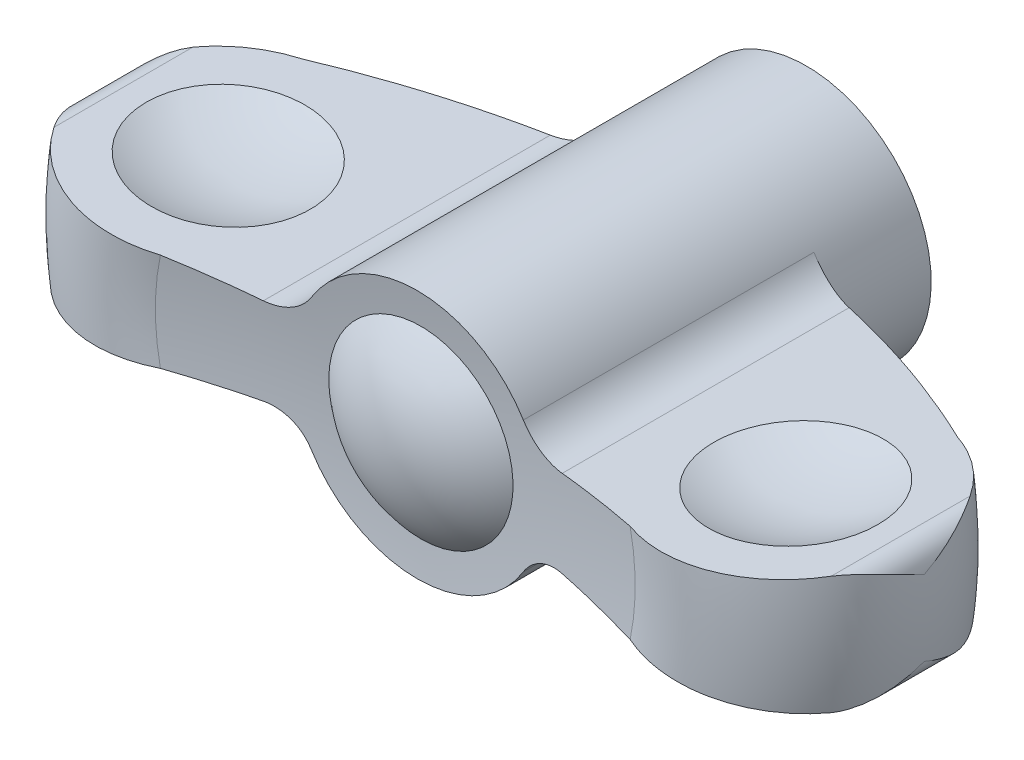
ISO-10303-21;
HEADER;
FILE_DESCRIPTION(('STEP AP214'),'2;1');
FILE_NAME('part.step','',(''),(''),'','','');
FILE_SCHEMA(('AUTOMOTIVE_DESIGN { 1 0 10303 214 1 1 1 1 }'));
ENDSEC;
DATA;
#1=APPLICATION_CONTEXT('core data for automotive mechanical design processes');
#2=APPLICATION_PROTOCOL_DEFINITION('international standard','automotive_design',2000,#1);
#3=PRODUCT_CONTEXT('',#1,'mechanical');
#4=PRODUCT('Part','Part','',(#3));
#5=PRODUCT_RELATED_PRODUCT_CATEGORY('part','',(#4));
#6=PRODUCT_DEFINITION_FORMATION('','',#4);
#7=PRODUCT_DEFINITION_CONTEXT('part definition',#1,'design');
#8=PRODUCT_DEFINITION('design','',#6,#7);
#9=PRODUCT_DEFINITION_SHAPE('','',#8);
#10=(LENGTH_UNIT() NAMED_UNIT(*) SI_UNIT(.MILLI.,.METRE.));
#11=(NAMED_UNIT(*) PLANE_ANGLE_UNIT() SI_UNIT($,.RADIAN.));
#12=(NAMED_UNIT(*) SI_UNIT($,.STERADIAN.) SOLID_ANGLE_UNIT());
#13=UNCERTAINTY_MEASURE_WITH_UNIT(LENGTH_MEASURE(1.E-05),#10,'distance_accuracy_value','');
#14=(GEOMETRIC_REPRESENTATION_CONTEXT(3) GLOBAL_UNCERTAINTY_ASSIGNED_CONTEXT((#13)) GLOBAL_UNIT_ASSIGNED_CONTEXT((#10,
#11,#12)) REPRESENTATION_CONTEXT('',''));
#15=CARTESIAN_POINT('',(0.,0.,0.));
#16=DIRECTION('',(0.,0.,1.));
#17=DIRECTION('',(1.,0.,0.));
#18=AXIS2_PLACEMENT_3D('',#15,#16,#17);
#19=CARTESIAN_POINT('',(0.,0.,29.));
#20=DIRECTION('',(0.,0.,1.));
#21=DIRECTION('',(1.09310760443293E-09,-1.,0.));
#22=AXIS2_PLACEMENT_3D('',#19,#20,#21);
#23=CYLINDRICAL_SURFACE('',#22,7.);
#24=CARTESIAN_POINT('',(0.,0.,26.));
#25=DIRECTION('',(0.,0.,1.));
#26=DIRECTION('',(1.09310760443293E-09,-1.,0.));
#27=AXIS2_PLACEMENT_3D('',#24,#25,#26);
#28=CIRCLE('',#27,7.);
#29=CARTESIAN_POINT('',(7.65175323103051E-09,-7.,26.));
#30=VERTEX_POINT('',#29);
#31=EDGE_CURVE('E9',#30,#30,#28,.T.);
#32=ORIENTED_EDGE('',*,*,#31,.T.);
#33=EDGE_LOOP('',(#32));
#34=FACE_BOUND('',#33,.T.);
#35=CARTESIAN_POINT('',(0.,0.,22.));
#36=DIRECTION('',(0.,0.,1.));
#37=DIRECTION('',(1.09310760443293E-09,-1.,0.));
#38=AXIS2_PLACEMENT_3D('',#35,#36,#37);
#39=CIRCLE('',#38,7.);
#40=CARTESIAN_POINT('',(7.65175323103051E-09,-7.,22.));
#41=VERTEX_POINT('',#40);
#42=EDGE_CURVE('E185',#41,#41,#39,.T.);
#43=ORIENTED_EDGE('',*,*,#42,.F.);
#44=EDGE_LOOP('',(#43));
#45=FACE_BOUND('',#44,.T.);
#46=ADVANCED_FACE('F14',(#34,#45),#23,.F.);
#47=CARTESIAN_POINT('',(5.,5.46553796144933E-09,20.));
#48=DIRECTION('',(0.,0.,1.));
#49=DIRECTION('',(1.09310760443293E-09,-1.,0.));
#50=AXIS2_PLACEMENT_3D('',#47,#48,#49);
#51=PLANE('',#50);
#52=CARTESIAN_POINT('',(0.,0.,20.));
#53=DIRECTION('',(0.,0.,1.));
#54=DIRECTION('',(1.09310760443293E-09,-1.,0.));
#55=AXIS2_PLACEMENT_3D('',#52,#53,#54);
#56=CIRCLE('',#55,5.25);
#57=CARTESIAN_POINT('',(5.73881492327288E-09,-5.25,20.));
#58=VERTEX_POINT('',#57);
#59=EDGE_CURVE('E191',#58,#58,#56,.T.);
#60=ORIENTED_EDGE('',*,*,#59,.T.);
#61=EDGE_LOOP('',(#60));
#62=FACE_BOUND('',#61,.T.);
#63=CARTESIAN_POINT('',(0.,0.,20.));
#64=DIRECTION('',(0.,0.,-1.));
#65=DIRECTION('',(-1.09310760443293E-09,1.,0.));
#66=AXIS2_PLACEMENT_3D('',#63,#64,#65);
#67=CIRCLE('',#66,5.);
#68=CARTESIAN_POINT('',(-5.46553802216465E-09,5.,20.));
#69=VERTEX_POINT('',#68);
#70=EDGE_CURVE('E528',#69,#69,#67,.T.);
#71=ORIENTED_EDGE('',*,*,#70,.T.);
#72=EDGE_LOOP('',(#71));
#73=FACE_BOUND('',#72,.T.);
#74=ADVANCED_FACE('F504',(#62,#73),#51,.T.);
#75=CARTESIAN_POINT('',(0.,0.,29.));
#76=DIRECTION('',(0.,0.,1.));
#77=DIRECTION('',(1.09310760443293E-09,-1.,0.));
#78=AXIS2_PLACEMENT_3D('',#75,#76,#77);
#79=CYLINDRICAL_SURFACE('',#78,5.25);
#80=CARTESIAN_POINT('',(0.,0.,22.));
#81=DIRECTION('',(0.,0.,1.));
#82=DIRECTION('',(1.09310760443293E-09,-1.,0.));
#83=AXIS2_PLACEMENT_3D('',#80,#81,#82);
#84=CIRCLE('',#83,5.25);
#85=CARTESIAN_POINT('',(5.73881492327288E-09,-5.25,22.));
#86=VERTEX_POINT('',#85);
#87=EDGE_CURVE('E188',#86,#86,#84,.T.);
#88=ORIENTED_EDGE('',*,*,#87,.T.);
#89=EDGE_LOOP('',(#88));
#90=FACE_BOUND('',#89,.T.);
#91=ORIENTED_EDGE('',*,*,#59,.F.);
#92=EDGE_LOOP('',(#91));
#93=FACE_BOUND('',#92,.T.);
#94=ADVANCED_FACE('F509',(#90,#93),#79,.F.);
#95=CARTESIAN_POINT('',(5.25,5.73881480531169E-09,22.));
#96=DIRECTION('',(0.,0.,1.));
#97=DIRECTION('',(1.09310760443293E-09,-1.,0.));
#98=AXIS2_PLACEMENT_3D('',#95,#96,#97);
#99=PLANE('',#98);
#100=ORIENTED_EDGE('',*,*,#42,.T.);
#101=EDGE_LOOP('',(#100));
#102=FACE_BOUND('',#101,.T.);
#103=ORIENTED_EDGE('',*,*,#87,.F.);
#104=EDGE_LOOP('',(#103));
#105=FACE_BOUND('',#104,.T.);
#106=ADVANCED_FACE('F513',(#102,#105),#99,.T.);
#107=CARTESIAN_POINT('',(5.25,5.73881480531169E-09,26.));
#108=DIRECTION('',(0.,0.,1.));
#109=DIRECTION('',(1.09310760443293E-09,-1.,0.));
#110=AXIS2_PLACEMENT_3D('',#107,#108,#109);
#111=PLANE('',#110);
#112=ORIENTED_EDGE('',*,*,#31,.F.);
#113=EDGE_LOOP('',(#112));
#114=FACE_BOUND('',#113,.T.);
#115=CARTESIAN_POINT('',(0.,0.,26.));
#116=DIRECTION('',(0.,0.,1.));
#117=DIRECTION('',(1.09310760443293E-09,-1.,0.));
#118=AXIS2_PLACEMENT_3D('',#115,#116,#117);
#119=CIRCLE('',#118,5.25);
#120=CARTESIAN_POINT('',(5.73881492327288E-09,-5.25,26.));
#121=VERTEX_POINT('',#120);
#122=EDGE_CURVE('E534',#121,#121,#119,.T.);
#123=ORIENTED_EDGE('',*,*,#122,.T.);
#124=EDGE_LOOP('',(#123));
#125=FACE_BOUND('',#124,.T.);
#126=ADVANCED_FACE('F516',(#114,#125),#111,.F.);
#127=CARTESIAN_POINT('',(0.,0.,19.6193190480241));
#128=DIRECTION('',(0.,0.,1.));
#129=DIRECTION('',(-1.,-1.09310760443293E-09,0.));
#130=AXIS2_PLACEMENT_3D('',#127,#128,#129);
#131=SPHERICAL_SURFACE('',#130,10.5431809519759);
#132=CARTESIAN_POINT('',(0.,0.,28.7624128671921));
#133=DIRECTION('',(0.,0.,1.));
#134=DIRECTION('',(1.09310760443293E-09,-1.,0.));
#135=AXIS2_PLACEMENT_3D('',#132,#133,#134);
#136=CIRCLE('',#135,5.25);
#137=CARTESIAN_POINT('',(5.73881492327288E-09,-5.25,28.7624128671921));
#138=VERTEX_POINT('',#137);
#139=EDGE_CURVE('E541',#138,#138,#136,.T.);
#140=ORIENTED_EDGE('',*,*,#139,.F.);
#141=EDGE_LOOP('',(#140));
#142=FACE_BOUND('',#141,.T.);
#143=ADVANCED_FACE('F596',(#142),#131,.F.);
#144=CARTESIAN_POINT('',(0.,0.,32.));
#145=DIRECTION('',(0.,0.,1.));
#146=DIRECTION('',(1.09310760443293E-09,-1.,0.));
#147=AXIS2_PLACEMENT_3D('',#144,#145,#146);
#148=CYLINDRICAL_SURFACE('',#147,5.25);
#149=ORIENTED_EDGE('',*,*,#122,.F.);
#150=EDGE_LOOP('',(#149));
#151=FACE_BOUND('',#150,.T.);
#152=ORIENTED_EDGE('',*,*,#139,.T.);
#153=EDGE_LOOP('',(#152));
#154=FACE_BOUND('',#153,.T.);
#155=ADVANCED_FACE('F599',(#151,#154),#148,.F.);
#156=CARTESIAN_POINT('',(0.,0.,20.));
#157=DIRECTION('',(0.,0.,-1.));
#158=DIRECTION('',(-1.09310760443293E-09,1.,0.));
#159=AXIS2_PLACEMENT_3D('',#156,#157,#158);
#160=CYLINDRICAL_SURFACE('',#159,5.);
#161=ORIENTED_EDGE('',*,*,#70,.F.);
#162=EDGE_LOOP('',(#161));
#163=FACE_BOUND('',#162,.T.);
#164=CARTESIAN_POINT('',(0.,0.,0.));
#165=DIRECTION('',(0.,0.,-1.));
#166=DIRECTION('',(-1.09310760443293E-09,1.,0.));
#167=AXIS2_PLACEMENT_3D('',#164,#165,#166);
#168=CIRCLE('',#167,5.);
#169=CARTESIAN_POINT('',(-5.46553802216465E-09,5.,0.));
#170=VERTEX_POINT('',#169);
#171=EDGE_CURVE('E531',#170,#170,#168,.T.);
#172=ORIENTED_EDGE('',*,*,#171,.T.);
#173=EDGE_LOOP('',(#172));
#174=FACE_BOUND('',#173,.T.);
#175=ADVANCED_FACE('F500',(#163,#174),#160,.F.);
#176=CARTESIAN_POINT('',(-20.6909836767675,-17.7680454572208,22.4));
#177=DIRECTION('',(-0.0653480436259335,0.997862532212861,0.));
#178=DIRECTION('',(-0.997862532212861,-0.0653480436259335,0.));
#179=AXIS2_PLACEMENT_3D('',#176,#177,#178);
#180=SPHERICAL_SURFACE('',#179,15.1703703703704);
#181=CARTESIAN_POINT('',(-21.5941178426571,-3.9772156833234,22.4));
#182=DIRECTION('',(-0.0653480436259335,0.997862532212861,0.));
#183=DIRECTION('',(-0.997862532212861,-0.0653480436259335,0.));
#184=AXIS2_PLACEMENT_3D('',#181,#182,#183);
#185=CIRCLE('',#184,6.2559971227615);
#186=CARTESIAN_POINT('',(-27.8367429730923,-4.38603285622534,22.4));
#187=VERTEX_POINT('',#186);
#188=EDGE_CURVE('E544',#187,#187,#185,.T.);
#189=ORIENTED_EDGE('',*,*,#188,.F.);
#190=EDGE_LOOP('',(#189));
#191=FACE_BOUND('',#190,.T.);
#192=ADVANCED_FACE('F493',(#191),#180,.F.);
#193=CARTESIAN_POINT('',(-29.5770181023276,-2.70000003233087,63.));
#194=DIRECTION('',(0.,0.,-1.));
#195=DIRECTION('',(-1.09310760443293E-09,1.,0.));
#196=AXIS2_PLACEMENT_3D('',#193,#194,#195);
#197=CYLINDRICAL_SURFACE('',#196,1.8);
#198=CARTESIAN_POINT('',(-31.3695646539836,-2.86363639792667,22.4));
#199=CARTESIAN_POINT('',(-31.3693228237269,-2.86628562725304,22.3940345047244));
#200=CARTESIAN_POINT('',(-31.3690751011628,-2.86893441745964,22.3880688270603));
#201=CARTESIAN_POINT('',(-31.3455550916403,-3.11453947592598,21.8347980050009));
#202=CARTESIAN_POINT('',(-31.2727100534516,-3.35362325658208,21.2860154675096));
#203=CARTESIAN_POINT('',(-31.0906514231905,-3.68216343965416,20.4682436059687));
#204=CARTESIAN_POINT('',(-31.017776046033,-3.78670948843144,20.1964122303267));
#205=CARTESIAN_POINT('',(-30.8477677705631,-3.98135444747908,19.6550362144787));
#206=CARTESIAN_POINT('',(-30.7506472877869,-4.07146071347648,19.3854904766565));
#207=CARTESIAN_POINT('',(-30.5719332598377,-4.20252903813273,18.947067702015));
#208=CARTESIAN_POINT('',(-30.4974342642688,-4.24947686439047,18.7770506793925));
#209=CARTESIAN_POINT('',(-30.3388744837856,-4.33328286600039,18.4391221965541));
#210=CARTESIAN_POINT('',(-30.2548212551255,-4.37014893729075,18.2712091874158));
#211=CARTESIAN_POINT('',(-30.0769796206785,-4.43174333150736,17.9372486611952));
#212=CARTESIAN_POINT('',(-29.9831491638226,-4.45641636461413,17.7712129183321));
#213=CARTESIAN_POINT('',(-29.8357178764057,-4.48201230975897,17.524748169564));
#214=CARTESIAN_POINT('',(-29.7853951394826,-4.48864310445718,17.4429276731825));
#215=CARTESIAN_POINT('',(-29.6826484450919,-4.49763628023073,17.2803342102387));
#216=CARTESIAN_POINT('',(-29.63022361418,-4.49999686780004,17.1995616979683));
#217=CARTESIAN_POINT('',(-29.5768181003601,-4.50000002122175,17.1194045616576));
#218=B_SPLINE_CURVE_WITH_KNOTS('',3,(#198,#199,#200,#201,#202,#203,#204,#205,#206,#207,#208,
#209,#210,#211,#212,#213,#214,#215,#216,#217),.UNSPECIFIED.,.F.,.F.,(4,2,2,2,2,2,2,2,2,4),(0.,
0.0195959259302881,1.81731826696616,2.7171233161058,3.61646853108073,4.19044381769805,
4.76396827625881,5.34007007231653,5.62881792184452,5.91768701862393),.UNSPECIFIED.);
#219=CARTESIAN_POINT('',(-31.3695646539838,-2.86363639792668,22.4));
#220=VERTEX_POINT('',#219);
#221=CARTESIAN_POINT('',(-29.57701810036,-4.50000003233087,17.1197047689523));
#222=VERTEX_POINT('',#221);
#223=EDGE_CURVE('E327',#220,#222,#218,.T.);
#224=ORIENTED_EDGE('',*,*,#223,.T.);
#225=DIRECTION('',(0.,0.,-1.));
#226=VECTOR('',#225,1.);
#227=CARTESIAN_POINT('',(-29.57701810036,-4.50000003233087,63.));
#228=LINE('',#227,#226);
#229=CARTESIAN_POINT('',(-29.57701810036,-4.50000003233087,27.6802952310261));
#230=VERTEX_POINT('',#229);
#231=EDGE_CURVE('E451',#230,#222,#228,.T.);
#232=ORIENTED_EDGE('',*,*,#231,.F.);
#233=CARTESIAN_POINT('',(-29.57681810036,-4.50000002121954,27.6805954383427));
#234=CARTESIAN_POINT('',(-29.6191393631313,-4.50000105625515,27.6170733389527));
#235=CARTESIAN_POINT('',(-29.660848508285,-4.4985172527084,27.5531608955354));
#236=CARTESIAN_POINT('',(-29.7429683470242,-4.49280702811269,27.4246477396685));
#237=CARTESIAN_POINT('',(-29.7833793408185,-4.48858124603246,27.3600471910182));
#238=CARTESIAN_POINT('',(-29.9024609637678,-4.47214708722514,27.1655066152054));
#239=CARTESIAN_POINT('',(-29.9791105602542,-4.4561804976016,27.0346321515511));
#240=CARTESIAN_POINT('',(-30.1263186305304,-4.41582928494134,26.7715169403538));
#241=CARTESIAN_POINT('',(-30.1969002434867,-4.3914785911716,26.6392837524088));
#242=CARTESIAN_POINT('',(-30.3321494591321,-4.33558292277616,26.3732577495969));
#243=CARTESIAN_POINT('',(-30.396813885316,-4.30403411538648,26.2394641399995));
#244=CARTESIAN_POINT('',(-30.562678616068,-4.21088538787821,25.8777358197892));
#245=CARTESIAN_POINT('',(-30.6582400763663,-4.14358643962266,25.6486491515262));
#246=CARTESIAN_POINT('',(-30.8316829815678,-3.99568955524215,25.1881545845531));
#247=CARTESIAN_POINT('',(-30.9095558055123,-3.91508516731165,24.9567456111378));
#248=CARTESIAN_POINT('',(-31.116683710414,-3.65806721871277,24.2592942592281));
#249=CARTESIAN_POINT('',(-31.2192514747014,-3.46657227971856,23.7904578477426));
#250=CARTESIAN_POINT('',(-31.306972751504,-3.20184760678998,23.1707445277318));
#251=CARTESIAN_POINT('',(-31.3245600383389,-3.13661939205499,23.0201631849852));
#252=CARTESIAN_POINT('',(-31.3522803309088,-3.00489994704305,22.7190103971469));
#253=CARTESIAN_POINT('',(-31.3624220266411,-2.93841028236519,22.5684391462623));
#254=CARTESIAN_POINT('',(-31.3690750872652,-2.86893448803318,22.4119313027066));
#255=CARTESIAN_POINT('',(-31.3693228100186,-2.86628569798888,22.4059656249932));
#256=CARTESIAN_POINT('',(-31.3695646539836,-2.86363639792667,22.4));
#257=B_SPLINE_CURVE_WITH_KNOTS('',3,(#233,#234,#235,#236,#237,#238,#239,#240,#241,#242,#243,
#244,#245,#246,#247,#248,#249,#250,#251,#252,#253,#254,#255,#256),.UNSPECIFIED.,.F.,.F.,(4,2,2,
2,2,2,2,2,2,2,2,4),(0.,0.228945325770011,0.45783731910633,0.91491838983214,1.37017104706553,
1.82566667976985,2.59598824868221,3.36668444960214,4.90952775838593,5.40460012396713,
5.89909375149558,5.9186896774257),.UNSPECIFIED.);
#258=EDGE_CURVE('E320',#230,#220,#257,.T.);
#259=ORIENTED_EDGE('',*,*,#258,.T.);
#260=EDGE_LOOP('',(#224,#232,#259));
#261=FACE_BOUND('',#260,.T.);
#262=ADVANCED_FACE('F488',(#261),#197,.T.);
#263=CARTESIAN_POINT('',(-29.5770181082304,2.69999996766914,63.));
#264=DIRECTION('',(0.,0.,-1.));
#265=DIRECTION('',(-1.09310760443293E-09,1.,0.));
#266=AXIS2_PLACEMENT_3D('',#263,#264,#265);
#267=CYLINDRICAL_SURFACE('',#266,1.8);
#268=CARTESIAN_POINT('',(-31.3695646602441,2.86363632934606,22.4));
#269=CARTESIAN_POINT('',(-31.3693228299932,2.86628555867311,22.4059654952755));
#270=CARTESIAN_POINT('',(-31.3690751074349,2.86893434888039,22.4119311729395));
#271=CARTESIAN_POINT('',(-31.3455550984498,3.11453940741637,22.9652019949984));
#272=CARTESIAN_POINT('',(-31.2727100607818,3.35362318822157,23.5139845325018));
#273=CARTESIAN_POINT('',(-31.0906514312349,3.68216337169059,24.3317563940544));
#274=CARTESIAN_POINT('',(-31.0177760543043,3.78670942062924,24.6035877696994));
#275=CARTESIAN_POINT('',(-30.8477677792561,3.98135438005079,25.1449637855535));
#276=CARTESIAN_POINT('',(-30.7506472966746,4.07146064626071,25.4145095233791));
#277=CARTESIAN_POINT('',(-30.57193326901,4.202528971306,25.8529322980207));
#278=CARTESIAN_POINT('',(-30.4974342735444,4.24947679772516,26.0229493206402));
#279=CARTESIAN_POINT('',(-30.338874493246,4.3332827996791,26.3608778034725));
#280=CARTESIAN_POINT('',(-30.2548212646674,4.37014887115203,26.5287908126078));
#281=CARTESIAN_POINT('',(-30.0769796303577,4.43174326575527,26.8627513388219));
#282=CARTESIAN_POINT('',(-29.9831491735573,4.45641629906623,27.0287870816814));
#283=CARTESIAN_POINT('',(-29.8357178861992,4.48201224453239,27.2752518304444));
#284=CARTESIAN_POINT('',(-29.7853951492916,4.48864303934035,27.3570723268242));
#285=CARTESIAN_POINT('',(-29.6826484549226,4.49763621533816,27.5196657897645));
#286=CARTESIAN_POINT('',(-29.6302236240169,4.49999680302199,27.6004383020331));
#287=CARTESIAN_POINT('',(-29.5768181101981,4.49999995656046,27.6805954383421));
#288=B_SPLINE_CURVE_WITH_KNOTS('',3,(#268,#269,#270,#271,#272,#273,#274,#275,#276,#277,#278,
#279,#280,#281,#282,#283,#284,#285,#286,#287),.UNSPECIFIED.,.F.,.F.,(4,2,2,2,2,2,2,2,2,4),(0.,
0.0195959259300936,1.81731826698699,2.7171233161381,3.6164685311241,4.19044381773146,
4.76396827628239,5.34007007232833,5.62881792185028,5.91768701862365),.UNSPECIFIED.);
#289=CARTESIAN_POINT('',(-31.3695646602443,2.86363632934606,22.4));
#290=VERTEX_POINT('',#289);
#291=CARTESIAN_POINT('',(-29.577018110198,4.49999996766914,27.6802952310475));
#292=VERTEX_POINT('',#291);
#293=EDGE_CURVE('E313',#290,#292,#288,.T.);
#294=ORIENTED_EDGE('',*,*,#293,.T.);
#295=DIRECTION('',(0.,0.,-1.));
#296=VECTOR('',#295,1.);
#297=CARTESIAN_POINT('',(-29.577018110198,4.49999996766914,63.));
#298=LINE('',#297,#296);
#299=CARTESIAN_POINT('',(-29.577018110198,4.49999996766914,17.1197047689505));
#300=VERTEX_POINT('',#299);
#301=EDGE_CURVE('E435',#292,#300,#298,.T.);
#302=ORIENTED_EDGE('',*,*,#301,.T.);
#303=CARTESIAN_POINT('',(-29.576818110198,4.49999995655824,17.119404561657));
#304=CARTESIAN_POINT('',(-29.6191393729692,4.50000099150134,17.1829266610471));
#305=CARTESIAN_POINT('',(-29.6608485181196,4.4985171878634,17.2468391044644));
#306=CARTESIAN_POINT('',(-29.7429683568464,4.49280696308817,17.3753522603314));
#307=CARTESIAN_POINT('',(-29.7833793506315,4.48858118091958,17.4399528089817));
#308=CARTESIAN_POINT('',(-29.9024609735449,4.47214702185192,17.6344933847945));
#309=CARTESIAN_POINT('',(-29.9791105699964,4.4561804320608,17.765367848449));
#310=CARTESIAN_POINT('',(-30.1263186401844,4.4158292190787,18.0284830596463));
#311=CARTESIAN_POINT('',(-30.1969002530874,4.39147852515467,18.1607162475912));
#312=CARTESIAN_POINT('',(-30.3321494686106,4.33558285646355,18.4267422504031));
#313=CARTESIAN_POINT('',(-30.3968138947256,4.30403404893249,18.5605358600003));
#314=CARTESIAN_POINT('',(-30.5626786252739,4.21088532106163,18.9222641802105));
#315=CARTESIAN_POINT('',(-30.658240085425,4.14358637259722,19.1513508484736));
#316=CARTESIAN_POINT('',(-30.8316829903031,3.9956894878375,19.6118454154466));
#317=CARTESIAN_POINT('',(-30.9095558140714,3.91508509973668,19.8432543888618));
#318=CARTESIAN_POINT('',(-31.1166837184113,3.65806715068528,20.5407057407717));
#319=CARTESIAN_POINT('',(-31.2192514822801,3.46657221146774,21.0095421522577));
#320=CARTESIAN_POINT('',(-31.3069727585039,3.20184753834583,21.6292554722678));
#321=CARTESIAN_POINT('',(-31.3245600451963,3.13661932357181,21.7798368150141));
#322=CARTESIAN_POINT('',(-31.3522803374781,3.0048998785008,22.0809896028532));
#323=CARTESIAN_POINT('',(-31.362422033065,2.93841021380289,22.2315608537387));
#324=CARTESIAN_POINT('',(-31.3690750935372,2.8689344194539,22.3880686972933));
#325=CARTESIAN_POINT('',(-31.3693228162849,2.86628562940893,22.3940343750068));
#326=CARTESIAN_POINT('',(-31.3695646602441,2.86363632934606,22.4));
#327=B_SPLINE_CURVE_WITH_KNOTS('',3,(#303,#304,#305,#306,#307,#308,#309,#310,#311,#312,#313,
#314,#315,#316,#317,#318,#319,#320,#321,#322,#323,#324,#325,#326),.UNSPECIFIED.,.F.,.F.,(4,2,2,
2,2,2,2,2,2,2,2,4),(0.,0.228945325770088,0.457837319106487,0.914918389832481,1.37017104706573,
1.8256666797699,2.59598824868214,3.36668444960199,4.90952775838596,5.40460012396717,
5.8990937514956,5.91868967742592),.UNSPECIFIED.);
#328=EDGE_CURVE('E305',#300,#290,#327,.T.);
#329=ORIENTED_EDGE('',*,*,#328,.T.);
#330=EDGE_LOOP('',(#294,#302,#329));
#331=FACE_BOUND('',#330,.T.);
#332=ADVANCED_FACE('F221',(#331),#267,.T.);
#333=CARTESIAN_POINT('',(-20.6909837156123,17.7680454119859,22.4));
#334=DIRECTION('',(0.0653480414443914,0.997862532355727,0.));
#335=DIRECTION('',(-0.997862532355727,0.0653480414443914,0.));
#336=AXIS2_PLACEMENT_3D('',#333,#334,#335);
#337=SPHERICAL_SURFACE('',#336,15.1703703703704);
#338=CARTESIAN_POINT('',(-21.5941178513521,3.97721563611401,22.4));
#339=DIRECTION('',(0.0653480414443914,0.997862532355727,0.));
#340=DIRECTION('',(-0.997862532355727,0.0653480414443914,0.));
#341=AXIS2_PLACEMENT_3D('',#338,#339,#340);
#342=CIRCLE('',#341,6.25599712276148);
#343=CARTESIAN_POINT('',(-27.836742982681,4.38603279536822,22.4));
#344=VERTEX_POINT('',#343);
#345=EDGE_CURVE('E547',#344,#344,#342,.T.);
#346=ORIENTED_EDGE('',*,*,#345,.T.);
#347=EDGE_LOOP('',(#346));
#348=FACE_BOUND('',#347,.T.);
#349=ADVANCED_FACE('F361',(#348),#337,.F.);
#350=CARTESIAN_POINT('',(29.5770181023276,2.70000003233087,63.));
#351=DIRECTION('',(0.,0.,-1.));
#352=DIRECTION('',(-1.09310760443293E-09,1.,0.));
#353=AXIS2_PLACEMENT_3D('',#350,#351,#352);
#354=CYLINDRICAL_SURFACE('',#353,1.8);
#355=CARTESIAN_POINT('',(31.3695646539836,2.86363639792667,22.4));
#356=CARTESIAN_POINT('',(31.3693228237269,2.86628562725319,22.3940345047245));
#357=CARTESIAN_POINT('',(31.3690751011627,2.86893441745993,22.3880688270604));
#358=CARTESIAN_POINT('',(31.3455550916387,3.11453947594,21.8347980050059));
#359=CARTESIAN_POINT('',(31.2727100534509,3.35362325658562,21.2860154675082));
#360=CARTESIAN_POINT('',(31.0906514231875,3.68216343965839,20.4682436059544));
#361=CARTESIAN_POINT('',(31.0177760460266,3.7867094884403,20.1964122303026));
#362=CARTESIAN_POINT('',(30.8477677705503,3.98135444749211,19.6550362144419));
#363=CARTESIAN_POINT('',(30.7506472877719,4.07146071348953,19.3854904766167));
#364=CARTESIAN_POINT('',(30.57193326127,4.20252903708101,18.9470677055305));
#365=CARTESIAN_POINT('',(30.4974342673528,4.24947686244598,18.7770506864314));
#366=CARTESIAN_POINT('',(30.3388744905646,4.33328286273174,18.4391222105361));
#367=CARTESIAN_POINT('',(30.2548212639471,4.37014893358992,18.2712092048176));
#368=CARTESIAN_POINT('',(30.0769796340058,4.43174332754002,17.9372486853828));
#369=CARTESIAN_POINT('',(29.9831491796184,4.45641636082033,17.7712129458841));
#370=CARTESIAN_POINT('',(29.8357178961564,4.48201230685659,17.5247482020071));
#371=CARTESIAN_POINT('',(29.7853951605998,4.48864310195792,17.4429277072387));
#372=CARTESIAN_POINT('',(29.6826484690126,4.49763627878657,17.2803342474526));
#373=CARTESIAN_POINT('',(29.6302236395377,4.49999686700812,17.1995617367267));
#374=CARTESIAN_POINT('',(29.5768181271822,4.50000002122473,17.1194046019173));
#375=B_SPLINE_CURVE_WITH_KNOTS('',3,(#355,#356,#357,#358,#359,#360,#361,#362,#363,#364,#365,
#366,#367,#368,#369,#370,#371,#372,#373,#374),.UNSPECIFIED.,.F.,.F.,(4,2,2,2,2,2,2,2,2,4),(0.,
0.0195959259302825,1.81731826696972,2.71712331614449,3.61646853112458,4.19044380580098,
4.76396825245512,5.34007003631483,5.62881787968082,5.91768697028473),.UNSPECIFIED.);
#376=CARTESIAN_POINT('',(31.3695646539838,2.86363639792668,22.4));
#377=VERTEX_POINT('',#376);
#378=CARTESIAN_POINT('',(29.5770181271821,4.50000003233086,17.1197048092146));
#379=VERTEX_POINT('',#378);
#380=EDGE_CURVE('E22',#377,#379,#375,.T.);
#381=ORIENTED_EDGE('',*,*,#380,.T.);
#382=DIRECTION('',(0.,0.,-1.));
#383=VECTOR('',#382,1.);
#384=CARTESIAN_POINT('',(29.5770181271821,4.50000003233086,63.));
#385=LINE('',#384,#383);
#386=CARTESIAN_POINT('',(29.5770181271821,4.50000003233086,27.6802951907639));
#387=VERTEX_POINT('',#386);
#388=EDGE_CURVE('E418',#387,#379,#385,.T.);
#389=ORIENTED_EDGE('',*,*,#388,.F.);
#390=CARTESIAN_POINT('',(29.5768181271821,4.50000002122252,27.6805953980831));
#391=CARTESIAN_POINT('',(29.6191393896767,4.5000010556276,27.6170732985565));
#392=CARTESIAN_POINT('',(29.6608485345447,4.49851725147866,27.553160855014));
#393=CARTESIAN_POINT('',(29.7429683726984,4.49280702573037,27.4246476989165));
#394=CARTESIAN_POINT('',(29.7833793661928,4.48858124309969,27.3600471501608));
#395=CARTESIAN_POINT('',(29.9024609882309,4.47214708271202,27.1655065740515));
#396=CARTESIAN_POINT('',(29.9791105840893,4.45618049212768,27.0346321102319));
#397=CARTESIAN_POINT('',(30.1263186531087,4.41582927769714,26.7715168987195));
#398=CARTESIAN_POINT('',(30.1969002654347,4.3914785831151,26.6392837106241));
#399=CARTESIAN_POINT('',(30.332149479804,4.3355829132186,26.3732577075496));
#400=CARTESIAN_POINT('',(30.3968139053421,4.3040341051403,26.2394640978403));
#401=CARTESIAN_POINT('',(30.5626786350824,4.21088537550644,25.8777357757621));
#402=CARTESIAN_POINT('',(30.6582400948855,4.14358642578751,25.6486491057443));
#403=CARTESIAN_POINT('',(30.8316829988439,3.99568953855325,25.1881545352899));
#404=CARTESIAN_POINT('',(30.90955582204,3.9150851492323,24.9567455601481));
#405=CARTESIAN_POINT('',(31.1166837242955,3.65806719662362,24.2592942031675));
#406=CARTESIAN_POINT('',(31.2192514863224,3.46657225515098,23.7904577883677));
#407=CARTESIAN_POINT('',(31.3069727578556,3.2018475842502,23.1707444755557));
#408=CARTESIAN_POINT('',(31.324560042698,3.13661937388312,23.0201631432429));
#409=CARTESIAN_POINT('',(31.3522803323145,3.00489993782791,22.7190103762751));
#410=CARTESIAN_POINT('',(31.3624220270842,2.93841027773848,22.5684391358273));
#411=CARTESIAN_POINT('',(31.3690750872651,2.86893448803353,22.4119313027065));
#412=CARTESIAN_POINT('',(31.3693228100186,2.86628569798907,22.4059656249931));
#413=CARTESIAN_POINT('',(31.3695646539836,2.86363639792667,22.4));
#414=B_SPLINE_CURVE_WITH_KNOTS('',3,(#390,#391,#392,#393,#394,#395,#396,#397,#398,#399,#400,
#401,#402,#403,#404,#405,#406,#407,#408,#409,#410,#411,#412,#413),.UNSPECIFIED.,.F.,.F.,(4,2,2,
2,2,2,2,2,2,2,2,4),(0.,0.228945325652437,0.45783731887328,0.914918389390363,1.37017104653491,
1.82566667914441,2.59598825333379,3.36668445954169,4.9095277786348,5.40460010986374,
5.89909370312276,5.91868962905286),.UNSPECIFIED.);
#415=EDGE_CURVE('E347',#387,#377,#414,.T.);
#416=ORIENTED_EDGE('',*,*,#415,.T.);
#417=EDGE_LOOP('',(#381,#389,#416));
#418=FACE_BOUND('',#417,.T.);
#419=ADVANCED_FACE('F357',(#418),#354,.T.);
#420=CARTESIAN_POINT('',(20.6909836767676,17.7680454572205,22.4));
#421=DIRECTION('',(0.0653480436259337,-0.997862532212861,0.));
#422=DIRECTION('',(-0.997862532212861,-0.0653480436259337,0.));
#423=AXIS2_PLACEMENT_3D('',#420,#421,#422);
#424=SPHERICAL_SURFACE('',#423,15.1703703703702);
#425=CARTESIAN_POINT('',(21.5941178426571,3.9772156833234,22.4));
#426=DIRECTION('',(0.0653480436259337,-0.997862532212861,0.));
#427=DIRECTION('',(0.997862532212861,0.0653480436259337,0.));
#428=AXIS2_PLACEMENT_3D('',#425,#426,#427);
#429=CIRCLE('',#428,6.25599712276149);
#430=CARTESIAN_POINT('',(27.8367429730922,4.38603285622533,22.4));
#431=VERTEX_POINT('',#430);
#432=EDGE_CURVE('E158',#431,#431,#429,.T.);
#433=ORIENTED_EDGE('',*,*,#432,.F.);
#434=EDGE_LOOP('',(#433));
#435=FACE_BOUND('',#434,.T.);
#436=ADVANCED_FACE('F360',(#435),#424,.F.);
#437=CARTESIAN_POINT('',(29.5770181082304,-2.69999996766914,63.));
#438=DIRECTION('',(0.,0.,-1.));
#439=DIRECTION('',(-1.09310760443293E-09,1.,0.));
#440=AXIS2_PLACEMENT_3D('',#437,#438,#439);
#441=CYLINDRICAL_SURFACE('',#440,1.8);
#442=CARTESIAN_POINT('',(31.3695646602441,-2.86363632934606,22.4));
#443=CARTESIAN_POINT('',(31.3693228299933,-2.86628555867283,22.4059654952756));
#444=CARTESIAN_POINT('',(31.3690751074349,-2.86893434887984,22.4119311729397));
#445=CARTESIAN_POINT('',(31.3455550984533,-3.11453940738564,22.9652019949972));
#446=CARTESIAN_POINT('',(31.2727100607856,-3.35362318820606,23.5139845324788));
#447=CARTESIAN_POINT('',(31.0906514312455,-3.68216337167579,24.3317563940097));
#448=CARTESIAN_POINT('',(31.0177760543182,-3.78670942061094,24.6035877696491));
#449=CARTESIAN_POINT('',(30.8477677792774,-3.98135438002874,25.1449637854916));
#450=CARTESIAN_POINT('',(30.7506472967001,-4.07146064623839,25.4145095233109));
#451=CARTESIAN_POINT('',(30.5719332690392,-4.20252897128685,25.8529322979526));
#452=CARTESIAN_POINT('',(30.4974342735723,-4.24947679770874,26.0229493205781));
#453=CARTESIAN_POINT('',(30.3388744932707,-4.33328279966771,26.3608778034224));
#454=CARTESIAN_POINT('',(30.2548212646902,-4.37014887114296,26.5287908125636));
#455=CARTESIAN_POINT('',(30.0769796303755,-4.43174326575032,26.8627513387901));
#456=CARTESIAN_POINT('',(29.9831491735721,-4.45641629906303,27.0287870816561));
#457=CARTESIAN_POINT('',(29.8357178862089,-4.48201224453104,27.2752518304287));
#458=CARTESIAN_POINT('',(29.7853951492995,-4.48864303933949,27.3570723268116));
#459=CARTESIAN_POINT('',(29.6826484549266,-4.49763621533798,27.5196657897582));
#460=CARTESIAN_POINT('',(29.630223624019,-4.49999680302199,27.6004383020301));
#461=CARTESIAN_POINT('',(29.5768181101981,-4.49999995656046,27.6805954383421));
#462=B_SPLINE_CURVE_WITH_KNOTS('',3,(#442,#443,#444,#445,#446,#447,#448,#449,#450,#451,#452,
#453,#454,#455,#456,#457,#458,#459,#460,#461),.UNSPECIFIED.,.F.,.F.,(4,2,2,2,2,2,2,2,2,4),(0.,
0.0195959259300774,1.81731826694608,2.71712331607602,3.61646853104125,4.19044381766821,
4.76396827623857,5.34007007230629,5.62881792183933,5.9176870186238),.UNSPECIFIED.);
#463=CARTESIAN_POINT('',(31.3695646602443,-2.86363632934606,22.4));
#464=VERTEX_POINT('',#463);
#465=CARTESIAN_POINT('',(29.577018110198,-4.49999996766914,27.6802952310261));
#466=VERTEX_POINT('',#465);
#467=EDGE_CURVE('E341',#464,#466,#462,.T.);
#468=ORIENTED_EDGE('',*,*,#467,.T.);
#469=DIRECTION('',(0.,0.,-1.));
#470=VECTOR('',#469,1.);
#471=CARTESIAN_POINT('',(29.577018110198,-4.49999996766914,63.));
#472=LINE('',#471,#470);
#473=CARTESIAN_POINT('',(29.577018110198,-4.49999996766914,17.1197047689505));
#474=VERTEX_POINT('',#473);
#475=EDGE_CURVE('E411',#466,#474,#472,.T.);
#476=ORIENTED_EDGE('',*,*,#475,.T.);
#477=CARTESIAN_POINT('',(29.576818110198,-4.49999995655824,17.119404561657));
#478=CARTESIAN_POINT('',(29.6191393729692,-4.50000099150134,17.1829266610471));
#479=CARTESIAN_POINT('',(29.6608485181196,-4.4985171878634,17.2468391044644));
#480=CARTESIAN_POINT('',(29.7429683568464,-4.49280696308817,17.3753522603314));
#481=CARTESIAN_POINT('',(29.7833793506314,-4.48858118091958,17.4399528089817));
#482=CARTESIAN_POINT('',(29.9024609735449,-4.47214702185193,17.6344933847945));
#483=CARTESIAN_POINT('',(29.9791105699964,-4.4561804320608,17.7653678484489));
#484=CARTESIAN_POINT('',(30.1263186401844,-4.41582921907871,18.0284830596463));
#485=CARTESIAN_POINT('',(30.1969002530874,-4.39147852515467,18.1607162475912));
#486=CARTESIAN_POINT('',(30.3321494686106,-4.33558285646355,18.426742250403));
#487=CARTESIAN_POINT('',(30.3968138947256,-4.30403404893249,18.5605358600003));
#488=CARTESIAN_POINT('',(30.5626786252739,-4.21088532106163,18.9222641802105));
#489=CARTESIAN_POINT('',(30.658240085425,-4.14358637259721,19.1513508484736));
#490=CARTESIAN_POINT('',(30.8316829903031,-3.99568948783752,19.6118454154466));
#491=CARTESIAN_POINT('',(30.9095558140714,-3.91508509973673,19.8432543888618));
#492=CARTESIAN_POINT('',(31.1166837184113,-3.6580671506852,20.5407057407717));
#493=CARTESIAN_POINT('',(31.2192514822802,-3.46657221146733,21.0095421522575));
#494=CARTESIAN_POINT('',(31.3069727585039,-3.20184753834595,21.6292554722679));
#495=CARTESIAN_POINT('',(31.3245600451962,-3.13661932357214,21.7798368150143));
#496=CARTESIAN_POINT('',(31.3522803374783,-3.00489987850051,22.080989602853));
#497=CARTESIAN_POINT('',(31.3624220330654,-2.93841021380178,22.2315608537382));
#498=CARTESIAN_POINT('',(31.3690750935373,-2.86893441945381,22.3880686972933));
#499=CARTESIAN_POINT('',(31.3693228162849,-2.86628562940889,22.3940343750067));
#500=CARTESIAN_POINT('',(31.3695646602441,-2.86363632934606,22.4));
#501=B_SPLINE_CURVE_WITH_KNOTS('',3,(#477,#478,#479,#480,#481,#482,#483,#484,#485,#486,#487,
#488,#489,#490,#491,#492,#493,#494,#495,#496,#497,#498,#499,#500),.UNSPECIFIED.,.F.,.F.,(4,2,2,
2,2,2,2,2,2,2,2,4),(0.,0.228945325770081,0.457837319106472,0.914918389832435,1.37017104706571,
1.8256666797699,2.59598824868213,3.36668444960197,4.90952775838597,5.40460012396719,
5.89909375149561,5.91868967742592),.UNSPECIFIED.);
#502=EDGE_CURVE('E334',#474,#464,#501,.T.);
#503=ORIENTED_EDGE('',*,*,#502,.T.);
#504=EDGE_LOOP('',(#468,#476,#503));
#505=FACE_BOUND('',#504,.T.);
#506=ADVANCED_FACE('F365',(#505),#441,.T.);
#507=CARTESIAN_POINT('',(20.6909837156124,-17.7680454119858,22.4));
#508=DIRECTION('',(-0.0653480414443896,-0.997862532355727,0.));
#509=DIRECTION('',(0.997862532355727,-0.0653480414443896,0.));
#510=AXIS2_PLACEMENT_3D('',#507,#508,#509);
#511=SPHERICAL_SURFACE('',#510,15.1703703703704);
#512=CARTESIAN_POINT('',(21.5941178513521,-3.97721563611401,22.4));
#513=DIRECTION('',(-0.0653480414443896,-0.997862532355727,0.));
#514=DIRECTION('',(0.997862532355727,-0.0653480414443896,0.));
#515=AXIS2_PLACEMENT_3D('',#512,#513,#514);
#516=CIRCLE('',#515,6.25599712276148);
#517=CARTESIAN_POINT('',(27.836742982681,-4.3860327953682,22.4));
#518=VERTEX_POINT('',#517);
#519=EDGE_CURVE('E550',#518,#518,#516,.T.);
#520=ORIENTED_EDGE('',*,*,#519,.T.);
#521=EDGE_LOOP('',(#520));
#522=FACE_BOUND('',#521,.T.);
#523=ADVANCED_FACE('F369',(#522),#511,.F.);
#524=CARTESIAN_POINT('',(-29.57701810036,-4.50000003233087,63.));
#525=DIRECTION('',(-0.0653480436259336,0.997862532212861,0.));
#526=DIRECTION('',(-0.997862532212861,-0.0653480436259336,0.));
#527=AXIS2_PLACEMENT_3D('',#524,#525,#526);
#528=PLANE('',#527);
#529=ORIENTED_EDGE('',*,*,#188,.T.);
#530=EDGE_LOOP('',(#529));
#531=FACE_BOUND('',#530,.T.);
#532=CARTESIAN_POINT('',(-18.1474454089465,-3.75149992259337,13.4105144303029));
#533=CARTESIAN_POINT('',(-17.890585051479,-3.73467864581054,13.5060281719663));
#534=CARTESIAN_POINT('',(-17.6377608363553,-3.71812168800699,13.6124268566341));
#535=CARTESIAN_POINT('',(-17.1419285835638,-3.68565061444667,13.846121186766));
#536=CARTESIAN_POINT('',(-16.8989202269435,-3.66973647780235,13.9734161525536));
#537=CARTESIAN_POINT('',(-16.4245099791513,-3.63866828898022,14.2479997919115));
#538=CARTESIAN_POINT('',(-16.1931050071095,-3.62351403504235,14.395283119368));
#539=CARTESIAN_POINT('',(-15.7434802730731,-3.5940690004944,14.708832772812));
#540=CARTESIAN_POINT('',(-15.5252603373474,-3.57977820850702,14.875098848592));
#541=CARTESIAN_POINT('',(-15.1034606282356,-3.55215537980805,15.2255617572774));
#542=CARTESIAN_POINT('',(-14.8998888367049,-3.53882386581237,15.4097682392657));
#543=CARTESIAN_POINT('',(-14.5090032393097,-3.51322554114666,15.7947666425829));
#544=CARTESIAN_POINT('',(-14.3216896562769,-3.50095874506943,15.9955587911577));
#545=CARTESIAN_POINT('',(-13.9647725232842,-3.47758494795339,16.4122828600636));
#546=CARTESIAN_POINT('',(-13.7951642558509,-3.46647763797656,16.628210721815));
#547=CARTESIAN_POINT('',(-13.4749045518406,-3.44550446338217,17.0737519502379));
#548=CARTESIAN_POINT('',(-13.3242529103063,-3.43563858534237,17.3033651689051));
#549=CARTESIAN_POINT('',(-13.043959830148,-3.41728274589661,17.7732237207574));
#550=CARTESIAN_POINT('',(-12.9141954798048,-3.40878473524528,18.0133954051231));
#551=CARTESIAN_POINT('',(-12.6756273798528,-3.39316138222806,18.5039680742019));
#552=CARTESIAN_POINT('',(-12.5668227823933,-3.38603598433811,18.7543686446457));
#553=CARTESIAN_POINT('',(-12.3710778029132,-3.37321703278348,19.2636307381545));
#554=CARTESIAN_POINT('',(-12.2841387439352,-3.36752356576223,19.5224927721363));
#555=CARTESIAN_POINT('',(-12.1328924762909,-3.35761874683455,20.0467739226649));
#556=CARTESIAN_POINT('',(-12.06858489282,-3.35340737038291,20.3121929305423));
#557=CARTESIAN_POINT('',(-11.9641647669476,-3.34656910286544,20.8426066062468));
#558=CARTESIAN_POINT('',(-11.9236219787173,-3.34391403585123,21.1075162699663));
#559=CARTESIAN_POINT('',(-11.8652424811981,-3.34009087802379,21.6398358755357));
#560=CARTESIAN_POINT('',(-11.8474054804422,-3.33892276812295,21.9072457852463));
#561=CARTESIAN_POINT('',(-11.8345982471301,-3.33808404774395,22.4425774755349));
#562=CARTESIAN_POINT('',(-11.8396248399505,-3.33841322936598,22.7104991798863));
#563=CARTESIAN_POINT('',(-11.8724923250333,-3.34056565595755,23.2449323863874));
#564=CARTESIAN_POINT('',(-11.9003330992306,-3.34238889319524,23.5114438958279));
#565=CARTESIAN_POINT('',(-11.9780680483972,-3.34747960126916,24.0376567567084));
#566=CARTESIAN_POINT('',(-12.0276696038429,-3.35072790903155,24.2974015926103));
#567=CARTESIAN_POINT('',(-12.1484267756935,-3.35863605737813,24.8118052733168));
#568=CARTESIAN_POINT('',(-12.2195821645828,-3.36329588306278,25.0664641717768));
#569=CARTESIAN_POINT('',(-12.3828443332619,-3.37398759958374,25.5689078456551));
#570=CARTESIAN_POINT('',(-12.4749485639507,-3.38001932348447,25.8166934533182));
#571=CARTESIAN_POINT('',(-12.6794078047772,-3.3934089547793,26.3038316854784));
#572=CARTESIAN_POINT('',(-12.7917703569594,-3.40076735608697,26.5431811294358));
#573=CARTESIAN_POINT('',(-13.0369078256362,-3.41682092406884,27.0137884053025));
#574=CARTESIAN_POINT('',(-13.169851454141,-3.4255271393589,27.2449579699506));
#575=CARTESIAN_POINT('',(-13.4544154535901,-3.44416267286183,27.6954567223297));
#576=CARTESIAN_POINT('',(-13.606036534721,-3.45409203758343,27.9147854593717));
#577=CARTESIAN_POINT('',(-13.9268367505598,-3.47510060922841,28.3401572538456));
#578=CARTESIAN_POINT('',(-14.0960166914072,-3.48617986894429,28.5461997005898));
#579=CARTESIAN_POINT('',(-14.4507138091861,-3.50940828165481,28.9436423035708));
#580=CARTESIAN_POINT('',(-14.6362312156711,-3.52155744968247,29.135042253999));
#581=CARTESIAN_POINT('',(-15.026026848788,-3.54708439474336,29.5054914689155));
#582=CARTESIAN_POINT('',(-15.2305978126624,-3.56048134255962,29.6842314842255));
#583=CARTESIAN_POINT('',(-15.6538967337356,-3.58820235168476,30.0239900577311));
#584=CARTESIAN_POINT('',(-15.8726245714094,-3.60252640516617,30.1850087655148));
#585=CARTESIAN_POINT('',(-16.3227525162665,-3.63200439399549,30.4882695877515));
#586=CARTESIAN_POINT('',(-16.5541555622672,-3.64715852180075,30.6305073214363));
#587=CARTESIAN_POINT('',(-17.0278914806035,-3.67818255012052,30.8951425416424));
#588=CARTESIAN_POINT('',(-17.270220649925,-3.69405220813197,31.0175466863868));
#589=CARTESIAN_POINT('',(-17.7669669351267,-3.72658313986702,31.2429802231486));
#590=CARTESIAN_POINT('',(-18.0214889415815,-3.7432512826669,31.3457775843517));
#591=CARTESIAN_POINT('',(-18.5382654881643,-3.77709395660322,31.5295393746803));
#592=CARTESIAN_POINT('',(-18.8005200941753,-3.79426849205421,31.6105036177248));
#593=CARTESIAN_POINT('',(-19.3309113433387,-3.82900276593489,31.7500060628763));
#594=CARTESIAN_POINT('',(-19.5990481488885,-3.84656251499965,31.808543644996));
#595=CARTESIAN_POINT('',(-20.1392890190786,-3.88194182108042,31.9027453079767));
#596=CARTESIAN_POINT('',(-20.4113930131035,-3.89976137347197,31.9384097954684));
#597=CARTESIAN_POINT('',(-20.9576381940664,-3.93553388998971,31.9865808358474));
#598=CARTESIAN_POINT('',(-21.2317794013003,-3.95348685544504,31.9990871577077));
#599=CARTESIAN_POINT('',(-21.7801364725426,-3.98939767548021,32.0008164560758));
#600=CARTESIAN_POINT('',(-22.0543523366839,-4.00735553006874,31.9900393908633));
#601=CARTESIAN_POINT('',(-22.6008596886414,-4.04314521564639,31.9452447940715));
#602=CARTESIAN_POINT('',(-22.8731513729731,-4.06097705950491,31.9112296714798));
#603=CARTESIAN_POINT('',(-23.4138724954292,-4.09638781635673,31.8201695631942));
#604=CARTESIAN_POINT('',(-23.6823019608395,-4.11396673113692,31.7631247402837));
#605=CARTESIAN_POINT('',(-24.2118784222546,-4.14864764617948,31.6267614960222));
#606=CARTESIAN_POINT('',(-24.473057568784,-4.1657517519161,31.5475684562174));
#607=CARTESIAN_POINT('',(-24.9877954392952,-4.19946091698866,31.3673123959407));
#608=CARTESIAN_POINT('',(-25.2413540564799,-4.21606596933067,31.2662490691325));
#609=CARTESIAN_POINT('',(-25.7391278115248,-4.24866418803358,31.0428965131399));
#610=CARTESIAN_POINT('',(-25.9833385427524,-4.26465706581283,30.9205974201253));
#611=CARTESIAN_POINT('',(-26.4605066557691,-4.29590586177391,30.6556646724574));
#612=CARTESIAN_POINT('',(-26.6934645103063,-4.31116181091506,30.5130318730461));
#613=CARTESIAN_POINT('',(-27.1452633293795,-4.34074922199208,30.209224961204));
#614=CARTESIAN_POINT('',(-27.3641711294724,-4.35508506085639,30.0481506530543));
#615=CARTESIAN_POINT('',(-27.7875858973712,-4.382813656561,29.7080080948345));
#616=CARTESIAN_POINT('',(-27.9920934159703,-4.39620644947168,29.5289405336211));
#617=CARTESIAN_POINT('',(-28.3848624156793,-4.42192811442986,29.1544313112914));
#618=CARTESIAN_POINT('',(-28.5731528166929,-4.43425888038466,28.9590200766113));
#619=CARTESIAN_POINT('',(-28.9324617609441,-4.45778931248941,28.5530043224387));
#620=CARTESIAN_POINT('',(-29.10349081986,-4.46898966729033,28.3424091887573));
#621=CARTESIAN_POINT('',(-29.3193740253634,-4.48312743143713,28.0522910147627));
#622=CARTESIAN_POINT('',(-29.3724491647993,-4.48660321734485,27.9788119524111));
#623=CARTESIAN_POINT('',(-29.4764415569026,-4.49341347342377,27.8304567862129));
#624=CARTESIAN_POINT('',(-29.5273611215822,-4.49674809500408,27.7555823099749));
#625=CARTESIAN_POINT('',(-29.57721810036,-4.50001312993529,27.6799920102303));
#626=B_SPLINE_CURVE_WITH_KNOTS('',3,(#532,#533,#534,#535,#536,#537,#538,#539,#540,#541,#542,
#543,#544,#545,#546,#547,#548,#549,#550,#551,#552,#553,#554,#555,#556,#557,#558,#559,#560,#561,
#562,#563,#564,#565,#566,#567,#568,#569,#570,#571,#572,#573,#574,#575,#576,#577,#578,#579,#580,
#581,#582,#583,#584,#585,#586,#587,#588,#589,#590,#591,#592,#593,#594,#595,#596,#597,#598,#599,
#600,#601,#602,#603,#604,#605,#606,#607,#608,#609,#610,#611,#612,#613,#614,#615,#616,#617,#618,
#619,#620,#621,#622,#623,#624,#625),.UNSPECIFIED.,.F.,.F.,(4,2,2,2,2,2,2,2,2,2,2,2,2,2,2,2,2,2,
2,2,2,2,2,2,2,2,2,2,2,2,2,2,2,2,2,2,2,2,2,2,2,2,2,2,2,2,4),(0.,0.82342903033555,
1.64683128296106,2.47001373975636,3.29318534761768,4.1168021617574,4.9404302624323,
5.76383834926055,6.58723753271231,7.40559872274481,8.22392680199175,9.04230438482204,
9.86066841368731,10.6637182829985,11.4667578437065,12.2696859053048,13.0726098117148,
13.8650526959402,14.6574872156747,15.449825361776,16.2424591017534,17.0419728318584,
17.8415169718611,18.6410978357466,19.4406899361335,20.2556974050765,21.0706979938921,
21.8858883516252,22.7008044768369,23.5248358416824,24.3488742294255,25.1729353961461,
25.9969819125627,26.8210366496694,27.6450928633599,28.4690636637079,29.2930286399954,
30.112420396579,30.9318236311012,31.7516084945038,32.5713588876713,33.3868657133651,
34.2023413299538,35.0163312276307,35.8298222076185,36.1019244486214,36.3737270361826),.UNSPECIFIED.);
#627=CARTESIAN_POINT('',(-17.8721248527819,-3.73346972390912,31.2823000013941));
#628=VERTEX_POINT('',#627);
#629=EDGE_CURVE('E267',#628,#230,#626,.T.);
#630=ORIENTED_EDGE('',*,*,#629,.T.);
#631=ORIENTED_EDGE('',*,*,#231,.T.);
#632=CARTESIAN_POINT('',(-29.57721810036,-4.50001312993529,17.1200079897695));
#633=CARTESIAN_POINT('',(-29.4265102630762,-4.49014357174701,16.8914517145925));
#634=CARTESIAN_POINT('',(-29.265980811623,-4.47963081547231,16.6694035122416));
#635=CARTESIAN_POINT('',(-28.9265816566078,-4.45740423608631,16.2398574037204));
#636=CARTESIAN_POINT('',(-28.7477118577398,-4.44569040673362,16.0323595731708));
#637=CARTESIAN_POINT('',(-28.3777669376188,-4.42146344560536,15.6385921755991));
#638=CARTESIAN_POINT('',(-28.1871252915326,-4.40897870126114,15.451913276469));
#639=CARTESIAN_POINT('',(-27.7910307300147,-4.38303925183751,15.0951091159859));
#640=CARTESIAN_POINT('',(-27.5855798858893,-4.36958468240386,14.9249815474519));
#641=CARTESIAN_POINT('',(-27.1888740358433,-4.34360520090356,14.623387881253));
#642=CARTESIAN_POINT('',(-26.9992422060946,-4.33118658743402,14.4897704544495));
#643=CARTESIAN_POINT('',(-26.6108442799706,-4.30575117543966,14.2366062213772));
#644=CARTESIAN_POINT('',(-26.4120783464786,-4.29273438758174,14.1170591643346));
#645=CARTESIAN_POINT('',(-26.0017910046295,-4.26586548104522,13.8900697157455));
#646=CARTESIAN_POINT('',(-25.7900813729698,-4.25200103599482,13.7829689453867));
#647=CARTESIAN_POINT('',(-25.3593415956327,-4.22379273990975,13.5846713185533));
#648=CARTESIAN_POINT('',(-25.1403106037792,-4.2094488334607,13.4934763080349));
#649=CARTESIAN_POINT('',(-24.9182172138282,-4.19490437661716,13.4105144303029));
#650=B_SPLINE_CURVE_WITH_KNOTS('',3,(#632,#633,#634,#635,#636,#637,#638,#639,#640,#641,#642,
#643,#644,#645,#646,#647,#648,#649),.UNSPECIFIED.,.F.,.F.,(4,2,2,2,2,2,2,2,4),(0.,
0.821594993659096,1.64319425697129,2.44361485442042,3.2439237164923,3.94026355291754,
4.63659097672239,5.34893288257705,6.0613574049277),.UNSPECIFIED.);
#651=CARTESIAN_POINT('',(-24.918752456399,-4.1949394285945,13.4107144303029));
#652=VERTEX_POINT('',#651);
#653=EDGE_CURVE('E29',#222,#652,#650,.T.);
#654=ORIENTED_EDGE('',*,*,#653,.T.);
#655=CARTESIAN_POINT('',(-24.9191403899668,-4.19496483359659,13.4109144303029));
#656=CARTESIAN_POINT('',(-23.8381391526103,-4.12417220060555,12.8535823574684));
#657=CARTESIAN_POINT('',(-22.7428134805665,-4.05244148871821,12.3242059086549));
#658=CARTESIAN_POINT('',(-20.5293345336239,-3.90748513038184,11.3241128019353));
#659=CARTESIAN_POINT('',(-19.4112500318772,-3.8342639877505,10.8532432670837));
#660=CARTESIAN_POINT('',(-17.1522467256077,-3.68632632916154,9.96991193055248));
#661=CARTESIAN_POINT('',(-16.0113274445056,-3.61160978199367,9.55745134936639));
#662=CARTESIAN_POINT('',(-14.2836536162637,-3.49846784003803,8.98318373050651));
#663=CARTESIAN_POINT('',(-13.7042390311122,-3.46052312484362,8.79894257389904));
#664=CARTESIAN_POINT('',(-12.5407906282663,-3.38433119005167,8.44572577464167));
#665=CARTESIAN_POINT('',(-11.9567567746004,-3.34608396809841,8.27675025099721));
#666=CARTESIAN_POINT('',(-11.370572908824,-3.30769594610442,8.115508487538));
#667=B_SPLINE_CURVE_WITH_KNOTS('',3,(#655,#656,#657,#658,#659,#660,#661,#662,#663,#664,#665,
#666),.UNSPECIFIED.,.F.,.F.,(4,2,2,2,2,4),(0.,3.65437061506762,7.29898215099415,
10.9436698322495,12.7710429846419,14.5984303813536),.UNSPECIFIED.);
#668=CARTESIAN_POINT('',(-11.370772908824,-3.30770904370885,8.1155634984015));
#669=VERTEX_POINT('',#668);
#670=EDGE_CURVE('E202',#652,#669,#667,.T.);
#671=ORIENTED_EDGE('',*,*,#670,.T.);
#672=DIRECTION('',(0.,0.,-1.));
#673=VECTOR('',#672,1.);
#674=CARTESIAN_POINT('',(-11.370772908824,-3.30770904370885,63.));
#675=LINE('',#674,#673);
#676=CARTESIAN_POINT('',(-11.370772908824,-3.30770904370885,29.9514557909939));
#677=VERTEX_POINT('',#676);
#678=EDGE_CURVE('E445',#677,#669,#675,.T.);
#679=ORIENTED_EDGE('',*,*,#678,.F.);
#680=CARTESIAN_POINT('',(0.167132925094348,-2.55211441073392,103.170910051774));
#681=DIRECTION('',(-0.0653480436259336,0.997862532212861,0.));
#682=DIRECTION('',(-0.997862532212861,-0.0653480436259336,0.));
#683=AXIS2_PLACEMENT_3D('',#680,#681,#682);
#684=CIRCLE('',#683,74.1268013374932);
#685=EDGE_CURVE('E425',#628,#677,#684,.F.);
#686=ORIENTED_EDGE('',*,*,#685,.F.);
#687=EDGE_LOOP('',(#630,#631,#654,#671,#679,#686));
#688=FACE_BOUND('',#687,.T.);
#689=ADVANCED_FACE('F250',(#531,#688),#528,.F.);
#690=CARTESIAN_POINT('',(0.,0.,22.4));
#691=DIRECTION('',(0.,0.,1.));
#692=DIRECTION('',(1.09310760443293E-09,-1.,0.));
#693=AXIS2_PLACEMENT_3D('',#690,#691,#692);
#694=TOROIDAL_SURFACE('',#693,21.8999999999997,9.6);
#695=ORIENTED_EDGE('',*,*,#629,.F.);
#696=CARTESIAN_POINT('',(0.,0.,31.2823000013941));
#697=DIRECTION('',(0.,0.,1.));
#698=DIRECTION('',(1.09310760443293E-09,-1.,0.));
#699=AXIS2_PLACEMENT_3D('',#696,#697,#698);
#700=CIRCLE('',#699,18.2579200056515);
#701=CARTESIAN_POINT('',(-17.8721248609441,3.7334696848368,31.2823000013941));
#702=VERTEX_POINT('',#701);
#703=EDGE_CURVE('E181',#702,#628,#700,.T.);
#704=ORIENTED_EDGE('',*,*,#703,.F.);
#705=CARTESIAN_POINT('',(-29.577218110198,4.50001306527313,27.6799920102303));
#706=CARTESIAN_POINT('',(-29.4283813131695,4.49026603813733,27.9057071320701));
#707=CARTESIAN_POINT('',(-29.2699701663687,4.47989200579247,28.1250732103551));
#708=CARTESIAN_POINT('',(-28.9352574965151,4.4579723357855,28.5496181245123));
#709=CARTESIAN_POINT('',(-28.7589571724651,4.44642677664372,28.7547979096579));
#710=CARTESIAN_POINT('',(-28.3898682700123,4.42225587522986,29.1493363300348));
#711=CARTESIAN_POINT('',(-28.1970944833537,4.40963150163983,29.3387088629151));
#712=CARTESIAN_POINT('',(-27.7963194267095,4.38338553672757,29.700509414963));
#713=CARTESIAN_POINT('',(-27.5883182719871,4.36976395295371,29.8729375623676));
#714=CARTESIAN_POINT('',(-27.1584989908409,4.3416159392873,30.1997036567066));
#715=CARTESIAN_POINT('',(-26.9366758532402,4.32708918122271,30.3540349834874));
#716=CARTESIAN_POINT('',(-26.4808650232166,4.29723903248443,30.6434656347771));
#717=CARTESIAN_POINT('',(-26.2468771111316,4.28191562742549,30.7785646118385));
#718=CARTESIAN_POINT('',(-25.7684462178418,4.25058413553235,31.0285776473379));
#719=CARTESIAN_POINT('',(-25.5240048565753,4.23457615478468,31.1434948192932));
#720=CARTESIAN_POINT('',(-25.0263706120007,4.20198707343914,31.3523874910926));
#721=CARTESIAN_POINT('',(-24.7731777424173,4.18540597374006,31.446363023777));
#722=CARTESIAN_POINT('',(-24.2590478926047,4.15173662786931,31.612996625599));
#723=CARTESIAN_POINT('',(-23.9980896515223,4.13464698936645,31.6855888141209));
#724=CARTESIAN_POINT('',(-23.4709078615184,4.10012289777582,31.8086173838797));
#725=CARTESIAN_POINT('',(-23.2046821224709,4.08268830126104,31.8590443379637));
#726=CARTESIAN_POINT('',(-22.6689091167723,4.04760158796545,31.9373839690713));
#727=CARTESIAN_POINT('',(-22.399361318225,4.02994943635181,31.9652929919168));
#728=CARTESIAN_POINT('',(-21.858996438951,3.99456201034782,31.9984159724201));
#729=CARTESIAN_POINT('',(-21.588179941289,3.97682677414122,32.003639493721));
#730=CARTESIAN_POINT('',(-21.0454404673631,3.94128384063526,31.9913795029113));
#731=CARTESIAN_POINT('',(-20.7735205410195,3.92347634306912,31.9737602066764));
#732=CARTESIAN_POINT('',(-20.232112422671,3.88802059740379,31.9157373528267));
#733=CARTESIAN_POINT('',(-19.9626242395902,3.87037234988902,31.8753337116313));
#734=CARTESIAN_POINT('',(-19.4280257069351,3.83536255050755,31.7720671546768));
#735=CARTESIAN_POINT('',(-19.1629144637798,3.81800094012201,31.7092088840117));
#736=CARTESIAN_POINT('',(-18.6387730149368,3.78367595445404,31.5614710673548));
#737=CARTESIAN_POINT('',(-18.3797450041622,3.76671272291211,31.4765837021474));
#738=CARTESIAN_POINT('',(-17.8682212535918,3.73321404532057,31.2848646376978));
#739=CARTESIAN_POINT('',(-17.6157711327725,3.7166815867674,31.1779106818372));
#740=CARTESIAN_POINT('',(-17.1207308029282,3.68426237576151,30.9431230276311));
#741=CARTESIAN_POINT('',(-16.878140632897,3.66837562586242,30.8152892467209));
#742=CARTESIAN_POINT('',(-16.4045275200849,3.63735964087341,30.5396362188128));
#743=CARTESIAN_POINT('',(-16.1735051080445,3.62223044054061,30.3918160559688));
#744=CARTESIAN_POINT('',(-15.7246795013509,3.59283774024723,30.0772205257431));
#745=CARTESIAN_POINT('',(-15.5068766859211,3.57857426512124,29.9104446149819));
#746=CARTESIAN_POINT('',(-15.0856203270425,3.55098702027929,29.5587225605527));
#747=CARTESIAN_POINT('',(-14.8821981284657,3.53766530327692,29.3737387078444));
#748=CARTESIAN_POINT('',(-14.4917116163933,3.51209311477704,28.9871837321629));
#749=CARTESIAN_POINT('',(-14.3046468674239,3.49984261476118,28.7856130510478));
#750=CARTESIAN_POINT('',(-13.948272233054,3.47650434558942,28.367276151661));
#751=CARTESIAN_POINT('',(-13.7789624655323,3.46541658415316,28.1505098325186));
#752=CARTESIAN_POINT('',(-13.4594078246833,3.44448958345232,27.7032976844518));
#753=CARTESIAN_POINT('',(-13.3091626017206,3.43465032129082,27.4728521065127));
#754=CARTESIAN_POINT('',(-13.0300075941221,3.416369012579,27.0017206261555));
#755=CARTESIAN_POINT('',(-12.9009427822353,3.40791681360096,26.7611269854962));
#756=CARTESIAN_POINT('',(-12.6638563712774,3.39239049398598,26.2698561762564));
#757=CARTESIAN_POINT('',(-12.55582645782,3.38531582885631,26.0191830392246));
#758=CARTESIAN_POINT('',(-12.3616487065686,3.37259951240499,25.5094385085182));
#759=CARTESIAN_POINT('',(-12.2755026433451,3.36695797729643,25.2503664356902));
#760=CARTESIAN_POINT('',(-12.1258566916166,3.35715796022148,24.7257346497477));
#761=CARTESIAN_POINT('',(-12.0623564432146,3.35299945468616,24.4601750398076));
#762=CARTESIAN_POINT('',(-11.9595441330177,3.34626648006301,23.9295575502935));
#763=CARTESIAN_POINT('',(-11.9198013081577,3.34366380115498,23.6645834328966));
#764=CARTESIAN_POINT('',(-11.8630211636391,3.33994538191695,23.1322038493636));
#765=CARTESIAN_POINT('',(-11.8459835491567,3.33882962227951,22.8647984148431));
#766=CARTESIAN_POINT('',(-11.8347668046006,3.33809505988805,22.3295252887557));
#767=CARTESIAN_POINT('',(-11.8405861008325,3.33847615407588,22.061657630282));
#768=CARTESIAN_POINT('',(-11.875027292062,3.34073163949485,21.5273997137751));
#769=CARTESIAN_POINT('',(-11.9036490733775,3.34260602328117,21.2610094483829));
#770=CARTESIAN_POINT('',(-11.9829240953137,3.3477975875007,20.7350583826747));
#771=CARTESIAN_POINT('',(-12.0332886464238,3.35109586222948,20.475453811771));
#772=CARTESIAN_POINT('',(-12.1555550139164,3.35910284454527,19.9613934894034));
#773=CARTESIAN_POINT('',(-12.2274566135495,3.36381153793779,19.7069376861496));
#774=CARTESIAN_POINT('',(-12.3921774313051,3.37459877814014,19.2049950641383));
#775=CARTESIAN_POINT('',(-12.4849912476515,3.38067697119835,18.9575064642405));
#776=CARTESIAN_POINT('',(-12.6908448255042,3.39415791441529,18.4709993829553));
#777=CARTESIAN_POINT('',(-12.8038936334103,3.40156125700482,18.2319847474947));
#778=CARTESIAN_POINT('',(-13.0503991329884,3.41770441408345,17.7620583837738));
#779=CARTESIAN_POINT('',(-13.1840279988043,3.42645550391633,17.5312373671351));
#780=CARTESIAN_POINT('',(-13.4698675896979,3.44517457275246,17.0815911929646));
#781=CARTESIAN_POINT('',(-13.6220707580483,3.4551420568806,16.8627612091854));
#782=CARTESIAN_POINT('',(-13.9440945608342,3.47623075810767,16.4382825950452));
#783=CARTESIAN_POINT('',(-14.1139279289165,3.48735280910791,16.2326436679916));
#784=CARTESIAN_POINT('',(-14.4698944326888,3.51066435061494,15.8360721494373));
#785=CARTESIAN_POINT('',(-14.6560271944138,3.52285381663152,15.6451392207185));
#786=CARTESIAN_POINT('',(-15.0471805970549,3.54846967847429,15.2755429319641));
#787=CARTESIAN_POINT('',(-15.2525053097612,3.56191598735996,15.0972026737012));
#788=CARTESIAN_POINT('',(-15.6772923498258,3.58973444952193,14.7583242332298));
#789=CARTESIAN_POINT('',(-15.8967545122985,3.60410659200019,14.5977858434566));
#790=CARTESIAN_POINT('',(-16.347893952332,3.63365082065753,14.2958496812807));
#791=CARTESIAN_POINT('',(-16.5795509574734,3.648821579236,14.1544214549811));
#792=CARTESIAN_POINT('',(-17.053703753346,3.67987290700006,13.8914238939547));
#793=CARTESIAN_POINT('',(-17.2961933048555,3.69575306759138,13.7698433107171));
#794=CARTESIAN_POINT('',(-17.6425873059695,3.71843772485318,13.6138611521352));
#795=CARTESIAN_POINT('',(-17.7426773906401,3.72499242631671,13.5707938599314));
#796=CARTESIAN_POINT('',(-17.9441132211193,3.73818406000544,13.4880908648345));
#797=CARTESIAN_POINT('',(-18.0454572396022,3.74482087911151,13.4484509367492));
#798=CARTESIAN_POINT('',(-18.1474454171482,3.75149988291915,13.4105144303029));
#799=B_SPLINE_CURVE_WITH_KNOTS('',3,(#705,#706,#707,#708,#709,#710,#711,#712,#713,#714,#715,
#716,#717,#718,#719,#720,#721,#722,#723,#724,#725,#726,#727,#728,#729,#730,#731,#732,#733,#734,
#735,#736,#737,#738,#739,#740,#741,#742,#743,#744,#745,#746,#747,#748,#749,#750,#751,#752,#753,
#754,#755,#756,#757,#758,#759,#760,#761,#762,#763,#764,#765,#766,#767,#768,#769,#770,#771,#772,
#773,#774,#775,#776,#777,#778,#779,#780,#781,#782,#783,#784,#785,#786,#787,#788,#789,#790,#791,
#792,#793,#794,#795,#796,#797,#798),.UNSPECIFIED.,.F.,.F.,(4,2,2,2,2,2,2,2,2,2,2,2,2,2,2,2,2,2,
2,2,2,2,2,2,2,2,2,2,2,2,2,2,2,2,2,2,2,2,2,2,2,2,2,2,2,2,4),(0.,0.811383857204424,
1.62271336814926,2.43332187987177,3.2439242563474,4.05482224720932,4.86573488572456,
5.6765223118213,6.48730846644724,7.3005670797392,8.11417124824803,8.92790742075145,
9.74130050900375,10.5595508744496,11.3778042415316,12.1958884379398,13.0142634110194,
13.8373004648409,14.6603407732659,15.4834188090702,16.3065204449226,17.1313641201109,
17.9561858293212,18.7810130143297,19.6058250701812,20.4243011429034,21.242453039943,
22.0606712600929,22.8788764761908,23.6817568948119,24.4846268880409,25.2874416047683,
26.0902523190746,26.8827166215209,27.6751729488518,28.4674248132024,29.2600317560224,
30.0596712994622,30.8589865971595,31.6588832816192,32.4587616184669,33.2746912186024,
34.0906113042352,34.905215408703,35.7193562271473,36.0467859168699,36.3738060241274),.UNSPECIFIED.);
#800=EDGE_CURVE('E235',#292,#702,#799,.T.);
#801=ORIENTED_EDGE('',*,*,#800,.F.);
#802=ORIENTED_EDGE('',*,*,#293,.F.);
#803=ORIENTED_EDGE('',*,*,#328,.F.);
#804=CARTESIAN_POINT('',(-24.9182172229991,4.19490432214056,13.4105144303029));
#805=CARTESIAN_POINT('',(-25.1747287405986,4.21170275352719,13.5063205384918));
#806=CARTESIAN_POINT('',(-25.4271515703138,4.22823342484,13.6131252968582));
#807=CARTESIAN_POINT('',(-25.9220334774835,4.26064226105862,13.847863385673));
#808=CARTESIAN_POINT('',(-26.1644920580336,4.27652039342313,13.9757977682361));
#809=CARTESIAN_POINT('',(-26.6315223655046,4.30710528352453,14.2483504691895));
#810=CARTESIAN_POINT('',(-26.8563943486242,4.32183170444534,14.3924524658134));
#811=CARTESIAN_POINT('',(-27.2933789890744,4.35044896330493,14.6988790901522));
#812=CARTESIAN_POINT('',(-27.5054935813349,4.36433992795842,14.8612009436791));
#813=CARTESIAN_POINT('',(-27.8883161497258,4.38941021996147,15.1803070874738));
#814=CARTESIAN_POINT('',(-28.0607864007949,4.40070495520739,15.3349749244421));
#815=CARTESIAN_POINT('',(-28.3941147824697,4.42253397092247,15.6563910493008));
#816=CARTESIAN_POINT('',(-28.5549737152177,4.43306830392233,15.8231385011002));
#817=CARTESIAN_POINT('',(-28.8677866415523,4.45355380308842,16.171824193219));
#818=CARTESIAN_POINT('',(-29.0194509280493,4.463485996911,16.3540235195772));
#819=CARTESIAN_POINT('',(-29.3089338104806,4.4824436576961,16.7291933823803));
#820=CARTESIAN_POINT('',(-29.4467504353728,4.49146899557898,16.9221654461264));
#821=CARTESIAN_POINT('',(-29.577218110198,4.50001306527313,17.1200079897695));
#822=B_SPLINE_CURVE_WITH_KNOTS('',3,(#804,#805,#806,#807,#808,#809,#810,#811,#812,#813,#814,
#815,#816,#817,#818,#819,#820,#821),.UNSPECIFIED.,.F.,.F.,(4,2,2,2,2,2,2,2,4),(0.,
0.82275942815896,1.64555983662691,2.44710662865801,3.24853154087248,3.9437587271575,
4.63893783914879,5.35009750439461,6.06135825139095),.UNSPECIFIED.);
#823=CARTESIAN_POINT('',(-24.9187524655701,4.19493937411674,13.4107144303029));
#824=VERTEX_POINT('',#823);
#825=EDGE_CURVE('E229',#824,#300,#822,.T.);
#826=ORIENTED_EDGE('',*,*,#825,.F.);
#827=CARTESIAN_POINT('',(0.,0.,13.4107144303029));
#828=DIRECTION('',(0.,0.,1.));
#829=DIRECTION('',(1.09310760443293E-09,-1.,0.));
#830=AXIS2_PLACEMENT_3D('',#827,#828,#829);
#831=CIRCLE('',#830,25.2693834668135);
#832=EDGE_CURVE('E177',#824,#652,#831,.T.);
#833=ORIENTED_EDGE('',*,*,#832,.T.);
#834=ORIENTED_EDGE('',*,*,#653,.F.);
#835=ORIENTED_EDGE('',*,*,#223,.F.);
#836=ORIENTED_EDGE('',*,*,#258,.F.);
#837=EDGE_LOOP('',(#695,#704,#801,#802,#803,#826,#833,#834,#835,#836));
#838=FACE_BOUND('',#837,.T.);
#839=ADVANCED_FACE('F219',(#838),#694,.T.);
#840=CARTESIAN_POINT('',(-11.3707729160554,3.3077090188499,63.));
#841=DIRECTION('',(-0.0653480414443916,-0.997862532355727,0.));
#842=DIRECTION('',(0.997862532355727,-0.0653480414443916,0.));
#843=AXIS2_PLACEMENT_3D('',#840,#841,#842);
#844=PLANE('',#843);
#845=ORIENTED_EDGE('',*,*,#345,.F.);
#846=EDGE_LOOP('',(#845));
#847=FACE_BOUND('',#846,.T.);
#848=DIRECTION('',(0.,0.,-1.));
#849=VECTOR('',#848,1.);
#850=CARTESIAN_POINT('',(-11.3707729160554,3.3077090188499,63.));
#851=LINE('',#850,#849);
#852=CARTESIAN_POINT('',(-11.3707729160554,3.3077090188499,29.9514557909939));
#853=VERTEX_POINT('',#852);
#854=CARTESIAN_POINT('',(-11.3707729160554,3.3077090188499,8.11556349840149));
#855=VERTEX_POINT('',#854);
#856=EDGE_CURVE('E142',#853,#855,#851,.T.);
#857=ORIENTED_EDGE('',*,*,#856,.T.);
#858=CARTESIAN_POINT('',(-11.3705729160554,3.3076959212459,8.11550848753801));
#859=CARTESIAN_POINT('',(-13.3194357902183,3.43532309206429,8.65165350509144));
#860=CARTESIAN_POINT('',(-15.2454387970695,3.56145321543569,9.27335320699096));
#861=CARTESIAN_POINT('',(-19.0285581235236,3.80920220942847,10.6774595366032));
#862=CARTESIAN_POINT('',(-20.8859409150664,3.93083853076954,11.4591449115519));
#863=CARTESIAN_POINT('',(-23.0778618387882,4.07438309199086,12.4939591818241));
#864=CARTESIAN_POINT('',(-23.4481408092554,4.09863192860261,12.6727423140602));
#865=CARTESIAN_POINT('',(-24.1858660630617,4.14694409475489,13.0369148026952));
#866=CARTESIAN_POINT('',(-24.5533094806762,4.17100723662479,13.2223099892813));
#867=CARTESIAN_POINT('',(-24.9191403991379,4.19496477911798,13.4109144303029));
#868=B_SPLINE_CURVE_WITH_KNOTS('',3,(#858,#859,#860,#861,#862,#863,#864,#865,#866,#867),
.UNSPECIFIED.,.F.,.F.,(4,2,2,2,4),(0.,6.07517314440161,12.1235385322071,13.3591937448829,
14.5959668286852),.UNSPECIFIED.);
#869=EDGE_CURVE('E194',#855,#824,#868,.T.);
#870=ORIENTED_EDGE('',*,*,#869,.T.);
#871=ORIENTED_EDGE('',*,*,#825,.T.);
#872=ORIENTED_EDGE('',*,*,#301,.F.);
#873=ORIENTED_EDGE('',*,*,#800,.T.);
#874=CARTESIAN_POINT('',(0.167132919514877,2.55211441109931,103.170910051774));
#875=DIRECTION('',(-0.0653480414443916,-0.997862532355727,0.));
#876=DIRECTION('',(0.997862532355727,-0.0653480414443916,0.));
#877=AXIS2_PLACEMENT_3D('',#874,#875,#876);
#878=CIRCLE('',#877,74.1268013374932);
#879=EDGE_CURVE('E431',#853,#702,#878,.F.);
#880=ORIENTED_EDGE('',*,*,#879,.F.);
#881=EDGE_LOOP('',(#857,#870,#871,#872,#873,#880));
#882=FACE_BOUND('',#881,.T.);
#883=ADVANCED_FACE('F213',(#847,#882),#844,.F.);
#884=CARTESIAN_POINT('',(0.,0.,21.456819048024));
#885=DIRECTION('',(0.,0.,1.));
#886=DIRECTION('',(-1.,-1.09310760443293E-09,0.));
#887=AXIS2_PLACEMENT_3D('',#884,#885,#886);
#888=SPHERICAL_SURFACE('',#887,10.5431809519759);
#889=CARTESIAN_POINT('',(0.,0.,29.3320056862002));
#890=DIRECTION('',(0.,0.,1.));
#891=DIRECTION('',(1.09310760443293E-09,-1.,0.));
#892=AXIS2_PLACEMENT_3D('',#889,#890,#891);
#893=CIRCLE('',#892,7.01);
#894=CARTESIAN_POINT('',(7.66268430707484E-09,-7.01,29.3320056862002));
#895=VERTEX_POINT('',#894);
#896=EDGE_CURVE('E530',#895,#895,#893,.T.);
#897=ORIENTED_EDGE('',*,*,#896,.T.);
#898=EDGE_LOOP('',(#897));
#899=FACE_BOUND('',#898,.T.);
#900=ADVANCED_FACE('F218',(#899),#888,.T.);
#901=CARTESIAN_POINT('',(18.1474454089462,3.75149992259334,13.4105144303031));
#902=CARTESIAN_POINT('',(17.8905850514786,3.73467864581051,13.5060281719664));
#903=CARTESIAN_POINT('',(17.637760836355,3.71812168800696,13.6124268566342));
#904=CARTESIAN_POINT('',(17.1419285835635,3.68565061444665,13.8461211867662));
#905=CARTESIAN_POINT('',(16.8989202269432,3.66973647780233,13.9734161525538));
#906=CARTESIAN_POINT('',(16.424509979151,3.63866828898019,14.2479997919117));
#907=CARTESIAN_POINT('',(16.1931050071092,3.62351403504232,14.3952831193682));
#908=CARTESIAN_POINT('',(15.7434802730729,3.59406900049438,14.7088327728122));
#909=CARTESIAN_POINT('',(15.5252603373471,3.579778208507,14.8750988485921));
#910=CARTESIAN_POINT('',(15.1034606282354,3.55215537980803,15.2255617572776));
#911=CARTESIAN_POINT('',(14.8998888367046,3.53882386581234,15.409768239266));
#912=CARTESIAN_POINT('',(14.5090032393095,3.51322554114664,15.7947666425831));
#913=CARTESIAN_POINT('',(14.3216896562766,3.50095874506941,15.995558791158));
#914=CARTESIAN_POINT('',(13.964772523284,3.47758494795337,16.4122828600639));
#915=CARTESIAN_POINT('',(13.7951642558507,3.46647763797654,16.6282107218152));
#916=CARTESIAN_POINT('',(13.4749045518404,3.44550446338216,17.0737519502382));
#917=CARTESIAN_POINT('',(13.3242529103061,3.43563858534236,17.3033651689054));
#918=CARTESIAN_POINT('',(13.0439598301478,3.41728274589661,17.7732237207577));
#919=CARTESIAN_POINT('',(12.9141954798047,3.40878473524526,18.0133954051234));
#920=CARTESIAN_POINT('',(12.6756273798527,3.39316138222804,18.5039680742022));
#921=CARTESIAN_POINT('',(12.5668227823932,3.3860359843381,18.754368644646));
#922=CARTESIAN_POINT('',(12.3710778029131,3.37321703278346,19.2636307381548));
#923=CARTESIAN_POINT('',(12.284138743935,3.36752356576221,19.5224927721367));
#924=CARTESIAN_POINT('',(12.1328924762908,3.35761874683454,20.0467739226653));
#925=CARTESIAN_POINT('',(12.06858489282,3.35340737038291,20.3121929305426));
#926=CARTESIAN_POINT('',(11.9641647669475,3.34656910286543,20.8426066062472));
#927=CARTESIAN_POINT('',(11.9236219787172,3.34391403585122,21.1075162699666));
#928=CARTESIAN_POINT('',(11.8652424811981,3.34009087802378,21.639835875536));
#929=CARTESIAN_POINT('',(11.8474054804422,3.33892276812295,21.9072457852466));
#930=CARTESIAN_POINT('',(11.8345982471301,3.33808404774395,22.4425774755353));
#931=CARTESIAN_POINT('',(11.8396248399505,3.33841322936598,22.7104991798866));
#932=CARTESIAN_POINT('',(11.8724923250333,3.34056565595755,23.2449323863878));
#933=CARTESIAN_POINT('',(11.9003330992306,3.34238889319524,23.5114438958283));
#934=CARTESIAN_POINT('',(11.9780680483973,3.34747960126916,24.0376567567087));
#935=CARTESIAN_POINT('',(12.027669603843,3.35072790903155,24.2974015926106));
#936=CARTESIAN_POINT('',(12.1484267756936,3.35863605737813,24.8118052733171));
#937=CARTESIAN_POINT('',(12.2195821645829,3.36329588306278,25.0664641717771));
#938=CARTESIAN_POINT('',(12.382844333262,3.37398759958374,25.5689078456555));
#939=CARTESIAN_POINT('',(12.4749485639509,3.38001932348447,25.8166934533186));
#940=CARTESIAN_POINT('',(12.6794078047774,3.3934089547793,26.3038316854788));
#941=CARTESIAN_POINT('',(12.7917703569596,3.40076735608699,26.5431811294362));
#942=CARTESIAN_POINT('',(13.0369078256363,3.41682092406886,27.0137884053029));
#943=CARTESIAN_POINT('',(13.1698514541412,3.42552713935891,27.2449579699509));
#944=CARTESIAN_POINT('',(13.4544154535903,3.44416267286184,27.69545672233));
#945=CARTESIAN_POINT('',(13.6060365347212,3.45409203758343,27.914785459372));
#946=CARTESIAN_POINT('',(13.9268367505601,3.47510060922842,28.3401572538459));
#947=CARTESIAN_POINT('',(14.0960166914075,3.4861798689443,28.5461997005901));
#948=CARTESIAN_POINT('',(14.4507138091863,3.50940828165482,28.9436423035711));
#949=CARTESIAN_POINT('',(14.6362312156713,3.52155744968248,29.1350422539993));
#950=CARTESIAN_POINT('',(15.0260268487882,3.54708439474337,29.5054914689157));
#951=CARTESIAN_POINT('',(15.2305978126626,3.56048134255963,29.6842314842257));
#952=CARTESIAN_POINT('',(15.6538967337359,3.58820235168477,30.0239900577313));
#953=CARTESIAN_POINT('',(15.8726245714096,3.60252640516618,30.1850087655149));
#954=CARTESIAN_POINT('',(16.3227525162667,3.6320043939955,30.4882695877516));
#955=CARTESIAN_POINT('',(16.5541555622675,3.64715852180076,30.6305073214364));
#956=CARTESIAN_POINT('',(17.0278914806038,3.67818255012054,30.8951425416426));
#957=CARTESIAN_POINT('',(17.2702206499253,3.69405220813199,31.017546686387));
#958=CARTESIAN_POINT('',(17.7669669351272,3.72658313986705,31.2429802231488));
#959=CARTESIAN_POINT('',(18.0214889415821,3.74325128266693,31.3457775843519));
#960=CARTESIAN_POINT('',(18.5382654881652,3.77709395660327,31.5295393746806));
#961=CARTESIAN_POINT('',(18.8005200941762,3.79426849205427,31.6105036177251));
#962=CARTESIAN_POINT('',(19.3309113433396,3.82900276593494,31.7500060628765));
#963=CARTESIAN_POINT('',(19.5990481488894,3.8465625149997,31.8085436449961));
#964=CARTESIAN_POINT('',(20.1392890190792,3.88194182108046,31.9027453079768));
#965=CARTESIAN_POINT('',(20.411393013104,3.899761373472,31.9384097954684));
#966=CARTESIAN_POINT('',(20.9576381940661,3.93553388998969,31.9865808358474));
#967=CARTESIAN_POINT('',(21.2317794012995,3.95348685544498,31.9990871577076));
#968=CARTESIAN_POINT('',(21.7801364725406,3.98939767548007,32.0008164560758));
#969=CARTESIAN_POINT('',(22.0543523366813,4.00735553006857,31.9900393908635));
#970=CARTESIAN_POINT('',(22.6008596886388,4.04314521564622,31.9452447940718));
#971=CARTESIAN_POINT('',(22.8731513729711,4.06097705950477,31.9112296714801));
#972=CARTESIAN_POINT('',(23.4138724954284,4.09638781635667,31.8201695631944));
#973=CARTESIAN_POINT('',(23.6823019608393,4.11396673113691,31.7631247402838));
#974=CARTESIAN_POINT('',(24.2118784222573,4.14864764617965,31.6267614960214));
#975=CARTESIAN_POINT('',(24.4730575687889,4.16575175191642,31.5475684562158));
#976=CARTESIAN_POINT('',(24.9877954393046,4.19946091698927,31.3673123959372));
#977=CARTESIAN_POINT('',(25.2413540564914,4.21606596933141,31.2662490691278));
#978=CARTESIAN_POINT('',(25.7391278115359,4.2486641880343,31.0428965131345));
#979=CARTESIAN_POINT('',(25.983338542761,4.26465706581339,30.9205974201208));
#980=CARTESIAN_POINT('',(26.4605066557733,4.29590586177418,30.6556646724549));
#981=CARTESIAN_POINT('',(26.6934645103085,4.31116181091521,30.5130318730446));
#982=CARTESIAN_POINT('',(27.1452633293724,4.34074922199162,30.2092249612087));
#983=CARTESIAN_POINT('',(27.3641711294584,4.35508506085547,30.0481506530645));
#984=CARTESIAN_POINT('',(27.7875858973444,4.38281365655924,29.708008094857));
#985=CARTESIAN_POINT('',(27.9920934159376,4.39620644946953,29.5289405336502));
#986=CARTESIAN_POINT('',(28.3848624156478,4.42192811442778,29.1544313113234));
#987=CARTESIAN_POINT('',(28.5731528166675,4.43425888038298,28.9590200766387));
#988=CARTESIAN_POINT('',(28.9324617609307,4.45778931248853,28.5530043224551));
#989=CARTESIAN_POINT('',(29.1034908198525,4.46898966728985,28.3424091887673));
#990=CARTESIAN_POINT('',(29.3193740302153,4.48312743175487,28.0522910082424));
#991=CARTESIAN_POINT('',(29.3724491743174,4.48660321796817,27.978811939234));
#992=CARTESIAN_POINT('',(29.476441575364,4.49341347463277,27.8304567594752));
#993=CARTESIAN_POINT('',(29.5273611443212,4.49674809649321,27.7555822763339));
#994=CARTESIAN_POINT('',(29.5772181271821,4.50001313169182,27.6799919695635));
#995=B_SPLINE_CURVE_WITH_KNOTS('',3,(#901,#902,#903,#904,#905,#906,#907,#908,#909,#910,#911,
#912,#913,#914,#915,#916,#917,#918,#919,#920,#921,#922,#923,#924,#925,#926,#927,#928,#929,#930,
#931,#932,#933,#934,#935,#936,#937,#938,#939,#940,#941,#942,#943,#944,#945,#946,#947,#948,#949,
#950,#951,#952,#953,#954,#955,#956,#957,#958,#959,#960,#961,#962,#963,#964,#965,#966,#967,#968,
#969,#970,#971,#972,#973,#974,#975,#976,#977,#978,#979,#980,#981,#982,#983,#984,#985,#986,#987,
#988,#989,#990,#991,#992,#993,#994),.UNSPECIFIED.,.F.,.F.,(4,2,2,2,2,2,2,2,2,2,2,2,2,2,2,2,2,2,
2,2,2,2,2,2,2,2,2,2,2,2,2,2,2,2,2,2,2,2,2,2,2,2,2,2,2,2,4),(0.,0.823429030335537,
1.64683128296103,2.47001373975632,3.29318534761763,4.11680216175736,4.94043026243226,
5.76383834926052,6.5872375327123,7.40559872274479,8.22392680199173,9.04230438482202,
9.8606684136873,10.6637182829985,11.4667578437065,12.2696859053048,13.0726098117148,
13.8650526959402,14.6574872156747,15.449825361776,16.2424591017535,17.0419728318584,
17.8415169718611,18.6410978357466,19.4406899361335,20.2556974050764,21.070697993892,
21.8858883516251,22.7008044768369,23.5248358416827,24.3488742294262,25.1729353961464,
25.9969819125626,26.8210366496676,27.6450928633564,28.4690636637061,29.2930286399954,
30.1124203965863,30.9318236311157,31.7516084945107,32.5713588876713,33.3868657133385,
34.2023413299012,35.0163312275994,35.8298222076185,36.1019244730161,36.3737270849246),.UNSPECIFIED.);
#996=CARTESIAN_POINT('',(17.8721248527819,3.73346972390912,31.2823000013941));
#997=VERTEX_POINT('',#996);
#998=EDGE_CURVE('E170',#997,#387,#995,.T.);
#999=ORIENTED_EDGE('',*,*,#998,.F.);
#1000=CARTESIAN_POINT('',(17.8721248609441,-3.7334696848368,31.2823000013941));
#1001=VERTEX_POINT('',#1000);
#1002=EDGE_CURVE('E182',#1001,#997,#700,.T.);
#1003=ORIENTED_EDGE('',*,*,#1002,.F.);
#1004=CARTESIAN_POINT('',(29.5772181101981,-4.50001306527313,27.6799920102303));
#1005=CARTESIAN_POINT('',(29.4283813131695,-4.49026603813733,27.9057071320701));
#1006=CARTESIAN_POINT('',(29.2699701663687,-4.47989200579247,28.125073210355));
#1007=CARTESIAN_POINT('',(28.9352574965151,-4.4579723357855,28.5496181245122));
#1008=CARTESIAN_POINT('',(28.7589571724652,-4.44642677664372,28.7547979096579));
#1009=CARTESIAN_POINT('',(28.3898682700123,-4.42225587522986,29.1493363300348));
#1010=CARTESIAN_POINT('',(28.1970944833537,-4.40963150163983,29.3387088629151));
#1011=CARTESIAN_POINT('',(27.7963194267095,-4.38338553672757,29.700509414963));
#1012=CARTESIAN_POINT('',(27.5883182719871,-4.36976395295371,29.8729375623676));
#1013=CARTESIAN_POINT('',(27.1584989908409,-4.3416159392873,30.1997036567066));
#1014=CARTESIAN_POINT('',(26.9366758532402,-4.32708918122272,30.3540349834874));
#1015=CARTESIAN_POINT('',(26.4808650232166,-4.29723903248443,30.6434656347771));
#1016=CARTESIAN_POINT('',(26.2468771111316,-4.28191562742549,30.7785646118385));
#1017=CARTESIAN_POINT('',(25.7684462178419,-4.25058413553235,31.0285776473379));
#1018=CARTESIAN_POINT('',(25.5240048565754,-4.23457615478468,31.1434948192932));
#1019=CARTESIAN_POINT('',(25.0263706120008,-4.20198707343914,31.3523874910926));
#1020=CARTESIAN_POINT('',(24.7731777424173,-4.18540597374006,31.446363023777));
#1021=CARTESIAN_POINT('',(24.2590478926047,-4.1517366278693,31.612996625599));
#1022=CARTESIAN_POINT('',(23.9980896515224,-4.13464698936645,31.6855888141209));
#1023=CARTESIAN_POINT('',(23.4709078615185,-4.10012289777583,31.8086173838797));
#1024=CARTESIAN_POINT('',(23.2046821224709,-4.08268830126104,31.8590443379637));
#1025=CARTESIAN_POINT('',(22.6689091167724,-4.04760158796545,31.9373839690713));
#1026=CARTESIAN_POINT('',(22.399361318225,-4.02994943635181,31.9652929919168));
#1027=CARTESIAN_POINT('',(21.858996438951,-3.99456201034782,31.9984159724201));
#1028=CARTESIAN_POINT('',(21.5881799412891,-3.97682677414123,32.003639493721));
#1029=CARTESIAN_POINT('',(21.0454404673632,-3.94128384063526,31.9913795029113));
#1030=CARTESIAN_POINT('',(20.7735205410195,-3.92347634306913,31.9737602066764));
#1031=CARTESIAN_POINT('',(20.232112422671,-3.88802059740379,31.9157373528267));
#1032=CARTESIAN_POINT('',(19.9626242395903,-3.87037234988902,31.8753337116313));
#1033=CARTESIAN_POINT('',(19.4280257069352,-3.83536255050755,31.7720671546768));
#1034=CARTESIAN_POINT('',(19.1629144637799,-3.81800094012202,31.7092088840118));
#1035=CARTESIAN_POINT('',(18.6387730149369,-3.78367595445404,31.5614710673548));
#1036=CARTESIAN_POINT('',(18.3797450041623,-3.76671272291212,31.4765837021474));
#1037=CARTESIAN_POINT('',(17.8682212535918,-3.73321404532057,31.2848646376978));
#1038=CARTESIAN_POINT('',(17.6157711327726,-3.7166815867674,31.1779106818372));
#1039=CARTESIAN_POINT('',(17.1207308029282,-3.68426237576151,30.9431230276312));
#1040=CARTESIAN_POINT('',(16.878140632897,-3.66837562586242,30.815289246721));
#1041=CARTESIAN_POINT('',(16.404527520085,-3.63735964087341,30.5396362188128));
#1042=CARTESIAN_POINT('',(16.1735051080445,-3.62223044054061,30.3918160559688));
#1043=CARTESIAN_POINT('',(15.7246795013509,-3.59283774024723,30.0772205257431));
#1044=CARTESIAN_POINT('',(15.5068766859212,-3.57857426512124,29.9104446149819));
#1045=CARTESIAN_POINT('',(15.0856203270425,-3.55098702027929,29.5587225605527));
#1046=CARTESIAN_POINT('',(14.8821981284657,-3.53766530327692,29.3737387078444));
#1047=CARTESIAN_POINT('',(14.4917116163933,-3.51209311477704,28.9871837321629));
#1048=CARTESIAN_POINT('',(14.3046468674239,-3.49984261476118,28.7856130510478));
#1049=CARTESIAN_POINT('',(13.948272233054,-3.47650434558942,28.367276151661));
#1050=CARTESIAN_POINT('',(13.7789624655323,-3.46541658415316,28.1505098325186));
#1051=CARTESIAN_POINT('',(13.4594078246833,-3.44448958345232,27.7032976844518));
#1052=CARTESIAN_POINT('',(13.3091626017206,-3.43465032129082,27.4728521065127));
#1053=CARTESIAN_POINT('',(13.0300075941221,-3.416369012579,27.0017206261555));
#1054=CARTESIAN_POINT('',(12.9009427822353,-3.40791681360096,26.7611269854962));
#1055=CARTESIAN_POINT('',(12.6638563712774,-3.39239049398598,26.2698561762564));
#1056=CARTESIAN_POINT('',(12.55582645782,-3.38531582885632,26.0191830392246));
#1057=CARTESIAN_POINT('',(12.3616487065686,-3.37259951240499,25.5094385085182));
#1058=CARTESIAN_POINT('',(12.2755026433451,-3.36695797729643,25.2503664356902));
#1059=CARTESIAN_POINT('',(12.1258566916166,-3.35715796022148,24.7257346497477));
#1060=CARTESIAN_POINT('',(12.0623564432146,-3.35299945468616,24.4601750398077));
#1061=CARTESIAN_POINT('',(11.9595441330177,-3.34626648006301,23.9295575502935));
#1062=CARTESIAN_POINT('',(11.9198013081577,-3.34366380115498,23.6645834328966));
#1063=CARTESIAN_POINT('',(11.8630211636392,-3.33994538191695,23.1322038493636));
#1064=CARTESIAN_POINT('',(11.8459835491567,-3.33882962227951,22.8647984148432));
#1065=CARTESIAN_POINT('',(11.8347668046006,-3.33809505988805,22.3295252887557));
#1066=CARTESIAN_POINT('',(11.8405861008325,-3.33847615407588,22.0616576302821));
#1067=CARTESIAN_POINT('',(11.875027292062,-3.34073163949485,21.5273997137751));
#1068=CARTESIAN_POINT('',(11.9036490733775,-3.34260602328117,21.2610094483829));
#1069=CARTESIAN_POINT('',(11.9829240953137,-3.3477975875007,20.7350583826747));
#1070=CARTESIAN_POINT('',(12.0332886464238,-3.35109586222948,20.475453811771));
#1071=CARTESIAN_POINT('',(12.1555550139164,-3.35910284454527,19.9613934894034));
#1072=CARTESIAN_POINT('',(12.2274566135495,-3.36381153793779,19.7069376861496));
#1073=CARTESIAN_POINT('',(12.3921774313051,-3.37459877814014,19.2049950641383));
#1074=CARTESIAN_POINT('',(12.4849912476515,-3.38067697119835,18.9575064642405));
#1075=CARTESIAN_POINT('',(12.6908448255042,-3.39415791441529,18.4709993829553));
#1076=CARTESIAN_POINT('',(12.8038936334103,-3.40156125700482,18.2319847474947));
#1077=CARTESIAN_POINT('',(13.0503991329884,-3.41770441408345,17.7620583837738));
#1078=CARTESIAN_POINT('',(13.1840279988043,-3.42645550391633,17.5312373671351));
#1079=CARTESIAN_POINT('',(13.4698675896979,-3.44517457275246,17.0815911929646));
#1080=CARTESIAN_POINT('',(13.6220707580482,-3.4551420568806,16.8627612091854));
#1081=CARTESIAN_POINT('',(13.9440945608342,-3.47623075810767,16.4382825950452));
#1082=CARTESIAN_POINT('',(14.1139279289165,-3.48735280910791,16.2326436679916));
#1083=CARTESIAN_POINT('',(14.4698944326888,-3.51066435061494,15.8360721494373));
#1084=CARTESIAN_POINT('',(14.6560271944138,-3.52285381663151,15.6451392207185));
#1085=CARTESIAN_POINT('',(15.0471805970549,-3.54846967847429,15.2755429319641));
#1086=CARTESIAN_POINT('',(15.2525053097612,-3.56191598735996,15.0972026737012));
#1087=CARTESIAN_POINT('',(15.6772923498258,-3.58973444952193,14.7583242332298));
#1088=CARTESIAN_POINT('',(15.8967545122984,-3.60410659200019,14.5977858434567));
#1089=CARTESIAN_POINT('',(16.3478939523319,-3.63365082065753,14.2958496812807));
#1090=CARTESIAN_POINT('',(16.5795509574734,-3.648821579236,14.1544214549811));
#1091=CARTESIAN_POINT('',(17.0537037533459,-3.67987290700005,13.8914238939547));
#1092=CARTESIAN_POINT('',(17.2961933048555,-3.69575306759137,13.7698433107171));
#1093=CARTESIAN_POINT('',(17.6425873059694,-3.71843772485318,13.6138611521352));
#1094=CARTESIAN_POINT('',(17.74267739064,-3.7249924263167,13.5707938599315));
#1095=CARTESIAN_POINT('',(17.9441132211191,-3.73818406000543,13.4880908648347));
#1096=CARTESIAN_POINT('',(18.0454572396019,-3.74482087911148,13.4484509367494));
#1097=CARTESIAN_POINT('',(18.1474454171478,-3.75149988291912,13.4105144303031));
#1098=B_SPLINE_CURVE_WITH_KNOTS('',3,(#1004,#1005,#1006,#1007,#1008,#1009,#1010,#1011,#1012,
#1013,#1014,#1015,#1016,#1017,#1018,#1019,#1020,#1021,#1022,#1023,#1024,#1025,#1026,#1027,#1028,
#1029,#1030,#1031,#1032,#1033,#1034,#1035,#1036,#1037,#1038,#1039,#1040,#1041,#1042,#1043,#1044,
#1045,#1046,#1047,#1048,#1049,#1050,#1051,#1052,#1053,#1054,#1055,#1056,#1057,#1058,#1059,#1060,
#1061,#1062,#1063,#1064,#1065,#1066,#1067,#1068,#1069,#1070,#1071,#1072,#1073,#1074,#1075,#1076,
#1077,#1078,#1079,#1080,#1081,#1082,#1083,#1084,#1085,#1086,#1087,#1088,#1089,#1090,#1091,#1092,
#1093,#1094,#1095,#1096,#1097),.UNSPECIFIED.,.F.,.F.,(4,2,2,2,2,2,2,2,2,2,2,2,2,2,2,2,2,2,2,2,2,
2,2,2,2,2,2,2,2,2,2,2,2,2,2,2,2,2,2,2,2,2,2,2,2,2,4),(0.,0.81138385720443,1.62271336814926,
2.43332187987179,3.24392425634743,4.05482224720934,4.86573488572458,5.6765223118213,
6.48730846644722,7.30056707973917,8.11417124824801,8.92790742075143,9.74130050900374,
10.5595508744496,11.3778042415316,12.1958884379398,13.0142634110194,13.8373004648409,
14.6603407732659,15.4834188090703,16.3065204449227,17.131364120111,17.9561858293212,
18.7810130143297,19.6058250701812,20.4243011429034,21.242453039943,22.0606712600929,
22.8788764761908,23.6817568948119,24.4846268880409,25.2874416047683,26.0902523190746,
26.8827166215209,27.6751729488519,28.4674248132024,29.2600317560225,30.0596712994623,
30.8589865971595,31.6588832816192,32.4587616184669,33.2746912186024,34.0906113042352,
34.905215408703,35.7193562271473,36.0467859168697,36.373806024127),.UNSPECIFIED.);
#1099=EDGE_CURVE('E284',#466,#1001,#1098,.T.);
#1100=ORIENTED_EDGE('',*,*,#1099,.F.);
#1101=ORIENTED_EDGE('',*,*,#467,.F.);
#1102=ORIENTED_EDGE('',*,*,#502,.F.);
#1103=CARTESIAN_POINT('',(24.9182172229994,-4.19490432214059,13.4105144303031));
#1104=CARTESIAN_POINT('',(25.174728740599,-4.21170275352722,13.506320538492));
#1105=CARTESIAN_POINT('',(25.4271515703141,-4.22823342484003,13.6131252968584));
#1106=CARTESIAN_POINT('',(25.9220334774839,-4.26064226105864,13.8478633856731));
#1107=CARTESIAN_POINT('',(26.1644920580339,-4.27652039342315,13.9757977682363));
#1108=CARTESIAN_POINT('',(26.6315223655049,-4.30710528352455,14.2483504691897));
#1109=CARTESIAN_POINT('',(26.8563943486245,-4.32183170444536,14.3924524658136));
#1110=CARTESIAN_POINT('',(27.2933789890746,-4.35044896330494,14.6988790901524));
#1111=CARTESIAN_POINT('',(27.5054935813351,-4.36433992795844,14.8612009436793));
#1112=CARTESIAN_POINT('',(27.888316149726,-4.38941021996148,15.1803070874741));
#1113=CARTESIAN_POINT('',(28.0607864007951,-4.40070495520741,15.3349749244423));
#1114=CARTESIAN_POINT('',(28.3941147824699,-4.42253397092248,15.656391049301));
#1115=CARTESIAN_POINT('',(28.5549737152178,-4.43306830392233,15.8231385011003));
#1116=CARTESIAN_POINT('',(28.8677866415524,-4.45355380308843,16.1718241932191));
#1117=CARTESIAN_POINT('',(29.0194509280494,-4.463485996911,16.3540235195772));
#1118=CARTESIAN_POINT('',(29.3089338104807,-4.4824436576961,16.7291933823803));
#1119=CARTESIAN_POINT('',(29.4467504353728,-4.49146899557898,16.9221654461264));
#1120=CARTESIAN_POINT('',(29.577218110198,-4.50001306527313,17.1200079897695));
#1121=B_SPLINE_CURVE_WITH_KNOTS('',3,(#1103,#1104,#1105,#1106,#1107,#1108,#1109,#1110,#1111,
#1112,#1113,#1114,#1115,#1116,#1117,#1118,#1119,#1120),.UNSPECIFIED.,.F.,.F.,(4,2,2,2,2,2,2,2,
4),(0.,0.822759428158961,1.64555983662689,2.44710662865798,3.24853154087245,3.94375872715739,
4.6389378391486,5.35009750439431,6.06135825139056),.UNSPECIFIED.);
#1122=CARTESIAN_POINT('',(24.9187524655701,-4.19493937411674,13.4107144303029));
#1123=VERTEX_POINT('',#1122);
#1124=EDGE_CURVE('E275',#1123,#474,#1121,.T.);
#1125=ORIENTED_EDGE('',*,*,#1124,.F.);
#1126=CARTESIAN_POINT('',(24.918752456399,4.1949394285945,13.4107144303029));
#1127=VERTEX_POINT('',#1126);
#1128=EDGE_CURVE('E178',#1123,#1127,#831,.T.);
#1129=ORIENTED_EDGE('',*,*,#1128,.T.);
#1130=CARTESIAN_POINT('',(29.5772181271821,4.50001313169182,17.1200080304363));
#1131=CARTESIAN_POINT('',(29.4265102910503,4.49014357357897,16.8914517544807));
#1132=CARTESIAN_POINT('',(29.2659808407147,4.47963081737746,16.6694035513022));
#1133=CARTESIAN_POINT('',(28.9265816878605,4.45740423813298,16.2398574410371));
#1134=CARTESIAN_POINT('',(28.7477118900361,4.44569040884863,16.032359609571));
#1135=CARTESIAN_POINT('',(28.3777669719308,4.42146344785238,15.6385922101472));
#1136=CARTESIAN_POINT('',(28.1871253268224,4.40897870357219,15.4519133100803));
#1137=CARTESIAN_POINT('',(27.7910307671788,4.38303925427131,15.0951091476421));
#1138=CARTESIAN_POINT('',(27.5855799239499,4.36958468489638,14.92498157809));
#1139=CARTESIAN_POINT('',(27.1888740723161,4.3436052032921,14.6233879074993));
#1140=CARTESIAN_POINT('',(26.9992422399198,4.33118658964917,14.4897704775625));
#1141=CARTESIAN_POINT('',(26.6108443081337,4.305751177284,14.2366062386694));
#1142=CARTESIAN_POINT('',(26.4120783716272,4.29273438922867,14.1170591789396));
#1143=CARTESIAN_POINT('',(26.0017910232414,4.26586548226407,13.8900697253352));
#1144=CARTESIAN_POINT('',(25.7900813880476,4.25200103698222,13.7829689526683));
#1145=CARTESIAN_POINT('',(25.3593416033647,4.22379274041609,13.5846713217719));
#1146=CARTESIAN_POINT('',(25.1403106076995,4.20944883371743,13.4934763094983));
#1147=CARTESIAN_POINT('',(24.9182172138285,4.19490437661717,13.4105144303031));
#1148=B_SPLINE_CURVE_WITH_KNOTS('',3,(#1130,#1131,#1132,#1133,#1134,#1135,#1136,#1137,#1138,
#1139,#1140,#1141,#1142,#1143,#1144,#1145,#1146,#1147),.UNSPECIFIED.,.F.,.F.,(4,2,2,2,2,2,2,2,
4),(0.,0.821594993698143,1.64319425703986,2.44361485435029,3.24392371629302,3.94026356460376,
4.63659100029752,5.34893291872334,6.06135745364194),.UNSPECIFIED.);
#1149=EDGE_CURVE('E292',#379,#1127,#1148,.T.);
#1150=ORIENTED_EDGE('',*,*,#1149,.F.);
#1151=ORIENTED_EDGE('',*,*,#380,.F.);
#1152=ORIENTED_EDGE('',*,*,#415,.F.);
#1153=EDGE_LOOP('',(#999,#1003,#1100,#1101,#1102,#1125,#1129,#1150,#1151,#1152));
#1154=FACE_BOUND('',#1153,.T.);
#1155=ADVANCED_FACE('F252',(#1154),#694,.T.);
#1156=CARTESIAN_POINT('',(29.57701810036,4.50000003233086,63.));
#1157=DIRECTION('',(0.0653480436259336,-0.997862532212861,0.));
#1158=DIRECTION('',(0.997862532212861,0.0653480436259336,0.));
#1159=AXIS2_PLACEMENT_3D('',#1156,#1157,#1158);
#1160=PLANE('',#1159);
#1161=ORIENTED_EDGE('',*,*,#432,.T.);
#1162=EDGE_LOOP('',(#1161));
#1163=FACE_BOUND('',#1162,.T.);
#1164=ORIENTED_EDGE('',*,*,#998,.T.);
#1165=ORIENTED_EDGE('',*,*,#388,.T.);
#1166=ORIENTED_EDGE('',*,*,#1149,.T.);
#1167=CARTESIAN_POINT('',(24.9191403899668,4.19496483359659,13.4109144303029));
#1168=CARTESIAN_POINT('',(23.8381391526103,4.12417220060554,12.8535823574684));
#1169=CARTESIAN_POINT('',(22.7428134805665,4.05244148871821,12.3242059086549));
#1170=CARTESIAN_POINT('',(20.5293345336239,3.90748513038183,11.3241128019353));
#1171=CARTESIAN_POINT('',(19.4112500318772,3.83426398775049,10.8532432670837));
#1172=CARTESIAN_POINT('',(17.1522467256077,3.68632632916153,9.96991193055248));
#1173=CARTESIAN_POINT('',(16.0113274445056,3.61160978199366,9.55745134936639));
#1174=CARTESIAN_POINT('',(14.2836536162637,3.49846784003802,8.98318373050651));
#1175=CARTESIAN_POINT('',(13.7042390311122,3.46052312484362,8.79894257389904));
#1176=CARTESIAN_POINT('',(12.5407906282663,3.38433119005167,8.44572577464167));
#1177=CARTESIAN_POINT('',(11.9567567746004,3.34608396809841,8.27675025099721));
#1178=CARTESIAN_POINT('',(11.370572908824,3.30769594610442,8.115508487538));
#1179=B_SPLINE_CURVE_WITH_KNOTS('',3,(#1167,#1168,#1169,#1170,#1171,#1172,#1173,#1174,#1175,
#1176,#1177,#1178),.UNSPECIFIED.,.F.,.F.,(4,2,2,2,2,4),(0.,3.65437061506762,7.29898215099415,
10.9436698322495,12.7710429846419,14.5984303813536),.UNSPECIFIED.);
#1180=CARTESIAN_POINT('',(11.370772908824,3.30770904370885,8.11556349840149));
#1181=VERTEX_POINT('',#1180);
#1182=EDGE_CURVE('E389',#1127,#1181,#1179,.T.);
#1183=ORIENTED_EDGE('',*,*,#1182,.T.);
#1184=DIRECTION('',(0.,0.,-1.));
#1185=VECTOR('',#1184,1.);
#1186=CARTESIAN_POINT('',(11.370772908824,3.30770904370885,63.));
#1187=LINE('',#1186,#1185);
#1188=CARTESIAN_POINT('',(11.370772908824,3.30770904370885,29.951455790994));
#1189=VERTEX_POINT('',#1188);
#1190=EDGE_CURVE('E462',#1189,#1181,#1187,.T.);
#1191=ORIENTED_EDGE('',*,*,#1190,.F.);
#1192=CARTESIAN_POINT('',(-0.167132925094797,2.55211441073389,103.170910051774));
#1193=DIRECTION('',(0.0653480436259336,-0.997862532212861,0.));
#1194=DIRECTION('',(0.997862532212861,0.0653480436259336,0.));
#1195=AXIS2_PLACEMENT_3D('',#1192,#1193,#1194);
#1196=CIRCLE('',#1195,74.1268013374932);
#1197=EDGE_CURVE('E166',#997,#1189,#1196,.F.);
#1198=ORIENTED_EDGE('',*,*,#1197,.F.);
#1199=EDGE_LOOP('',(#1164,#1165,#1166,#1183,#1191,#1198));
#1200=FACE_BOUND('',#1199,.T.);
#1201=ADVANCED_FACE('F363',(#1163,#1200),#1160,.F.);
#1202=CARTESIAN_POINT('',(11.3707729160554,-3.3077090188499,63.));
#1203=DIRECTION('',(0.0653480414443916,0.997862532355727,0.));
#1204=DIRECTION('',(-0.997862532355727,0.0653480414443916,0.));
#1205=AXIS2_PLACEMENT_3D('',#1202,#1203,#1204);
#1206=PLANE('',#1205);
#1207=ORIENTED_EDGE('',*,*,#519,.F.);
#1208=EDGE_LOOP('',(#1207));
#1209=FACE_BOUND('',#1208,.T.);
#1210=DIRECTION('',(0.,0.,-1.));
#1211=VECTOR('',#1210,1.);
#1212=CARTESIAN_POINT('',(11.3707729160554,-3.3077090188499,63.));
#1213=LINE('',#1212,#1211);
#1214=CARTESIAN_POINT('',(11.3707729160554,-3.3077090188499,29.9514557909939));
#1215=VERTEX_POINT('',#1214);
#1216=CARTESIAN_POINT('',(11.3707729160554,-3.3077090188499,8.11556349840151));
#1217=VERTEX_POINT('',#1216);
#1218=EDGE_CURVE('E419',#1215,#1217,#1213,.T.);
#1219=ORIENTED_EDGE('',*,*,#1218,.T.);
#1220=CARTESIAN_POINT('',(11.3705729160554,-3.3076959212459,8.11550848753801));
#1221=CARTESIAN_POINT('',(13.3194357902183,-3.43532309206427,8.65165350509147));
#1222=CARTESIAN_POINT('',(15.2454387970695,-3.56145321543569,9.27335320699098));
#1223=CARTESIAN_POINT('',(19.0285581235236,-3.80920220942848,10.6774595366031));
#1224=CARTESIAN_POINT('',(20.8859409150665,-3.93083853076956,11.4591449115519));
#1225=CARTESIAN_POINT('',(23.0778618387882,-4.07438309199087,12.4939591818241));
#1226=CARTESIAN_POINT('',(23.4481408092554,-4.09863192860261,12.6727423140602));
#1227=CARTESIAN_POINT('',(24.1858660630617,-4.14694409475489,13.0369148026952));
#1228=CARTESIAN_POINT('',(24.5533094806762,-4.17100723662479,13.2223099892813));
#1229=CARTESIAN_POINT('',(24.9191403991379,-4.19496477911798,13.4109144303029));
#1230=B_SPLINE_CURVE_WITH_KNOTS('',3,(#1220,#1221,#1222,#1223,#1224,#1225,#1226,#1227,#1228,
#1229),.UNSPECIFIED.,.F.,.F.,(4,2,2,2,4),(0.,6.07517314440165,12.1235385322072,13.3591937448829,
14.5959668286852),.UNSPECIFIED.);
#1231=EDGE_CURVE('E383',#1217,#1123,#1230,.T.);
#1232=ORIENTED_EDGE('',*,*,#1231,.T.);
#1233=ORIENTED_EDGE('',*,*,#1124,.T.);
#1234=ORIENTED_EDGE('',*,*,#475,.F.);
#1235=ORIENTED_EDGE('',*,*,#1099,.T.);
#1236=CARTESIAN_POINT('',(-0.167132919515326,-2.55211441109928,103.170910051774));
#1237=DIRECTION('',(0.0653480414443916,0.997862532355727,0.));
#1238=DIRECTION('',(-0.997862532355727,0.0653480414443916,0.));
#1239=AXIS2_PLACEMENT_3D('',#1236,#1237,#1238);
#1240=CIRCLE('',#1239,74.1268013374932);
#1241=EDGE_CURVE('E422',#1215,#1001,#1240,.F.);
#1242=ORIENTED_EDGE('',*,*,#1241,.F.);
#1243=EDGE_LOOP('',(#1219,#1232,#1233,#1234,#1235,#1242));
#1244=FACE_BOUND('',#1243,.T.);
#1245=ADVANCED_FACE('F371',(#1209,#1244),#1206,.F.);
#1246=CARTESIAN_POINT('',(11.1355199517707,6.90001415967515,63.));
#1247=DIRECTION('',(0.,0.,-1.));
#1248=DIRECTION('',(-1.09310760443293E-09,1.,0.));
#1249=AXIS2_PLACEMENT_3D('',#1246,#1247,#1248);
#1250=CYLINDRICAL_SURFACE('',#1249,3.6);
#1251=CARTESIAN_POINT('',(8.07525307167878,5.00402718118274,29.6109080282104));
#1252=CARTESIAN_POINT('',(8.1279773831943,4.91890610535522,29.6109050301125));
#1253=CARTESIAN_POINT('',(8.18426788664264,4.83600039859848,29.6116495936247));
#1254=CARTESIAN_POINT('',(8.30353556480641,4.67518470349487,29.6146197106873));
#1255=CARTESIAN_POINT('',(8.36651222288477,4.59727432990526,29.6168451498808));
#1256=CARTESIAN_POINT('',(8.49861978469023,4.44710893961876,29.6227586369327));
#1257=CARTESIAN_POINT('',(8.56774171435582,4.37484595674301,29.6264445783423));
#1258=CARTESIAN_POINT('',(8.71168118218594,4.23637135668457,29.6352474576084));
#1259=CARTESIAN_POINT('',(8.78649866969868,4.1701596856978,29.64036438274));
#1260=CARTESIAN_POINT('',(9.0187510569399,3.98127784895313,29.6578137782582));
#1261=CARTESIAN_POINT('',(9.18407289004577,3.86826220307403,29.6722487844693));
#1262=CARTESIAN_POINT('',(9.53070421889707,3.67133522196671,29.7062861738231));
#1263=CARTESIAN_POINT('',(9.71201988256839,3.58743517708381,29.725890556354));
#1264=CARTESIAN_POINT('',(10.0868745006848,3.4503081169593,29.7698552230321));
#1265=CARTESIAN_POINT('',(10.2804937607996,3.39731194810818,29.7942495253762));
#1266=CARTESIAN_POINT('',(10.673145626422,3.32426624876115,29.8469878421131));
#1267=CARTESIAN_POINT('',(10.8721695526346,3.30416674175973,29.8753257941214));
#1268=CARTESIAN_POINT('',(11.1210683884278,3.29969229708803,29.9127340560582));
#1269=CARTESIAN_POINT('',(11.1711558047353,3.29984127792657,29.9203619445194));
#1270=CARTESIAN_POINT('',(11.2711743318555,3.30222485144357,29.9357928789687));
#1271=CARTESIAN_POINT('',(11.3211055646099,3.30445620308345,29.9435956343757));
#1272=CARTESIAN_POINT('',(11.370972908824,3.30772214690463,29.9514874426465));
#1273=B_SPLINE_CURVE_WITH_KNOTS('',3,(#1251,#1252,#1253,#1254,#1255,#1256,#1257,#1258,#1259,
#1260,#1261,#1262,#1263,#1264,#1265,#1266,#1267,#1268,#1269,#1270,#1271,#1272),.UNSPECIFIED.,
.F.,.F.,(4,2,2,2,2,2,2,2,2,2,4),(0.,0.300282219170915,0.600541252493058,0.900368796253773,
1.20019367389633,1.79945360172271,2.39894564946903,3.00286025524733,3.60585654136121,
3.75782672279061,3.90956076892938),.UNSPECIFIED.);
#1274=CARTESIAN_POINT('',(8.07537699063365,5.00382718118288,29.6109080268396));
#1275=VERTEX_POINT('',#1274);
#1276=EDGE_CURVE('E164',#1275,#1189,#1273,.T.);
#1277=ORIENTED_EDGE('',*,*,#1276,.T.);
#1278=ORIENTED_EDGE('',*,*,#1190,.T.);
#1279=CARTESIAN_POINT('',(8.07525307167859,5.00402718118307,7.50000000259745));
#1280=CARTESIAN_POINT('',(8.12665441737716,4.92103792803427,7.49999174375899));
#1281=CARTESIAN_POINT('',(8.18144847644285,4.84015839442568,7.50133541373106));
#1282=CARTESIAN_POINT('',(8.29736168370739,4.6831802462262,7.50668033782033));
#1283=CARTESIAN_POINT('',(8.35847975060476,4.60708081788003,7.51068113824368));
#1284=CARTESIAN_POINT('',(8.48644165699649,4.46037546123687,7.52128108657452));
#1285=CARTESIAN_POINT('',(8.55327111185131,4.38975653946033,7.52787384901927));
#1286=CARTESIAN_POINT('',(8.69224285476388,4.25429572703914,7.5435639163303));
#1287=CARTESIAN_POINT('',(8.7643851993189,4.18945389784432,7.55266124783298));
#1288=CARTESIAN_POINT('',(8.98795737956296,4.00427143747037,7.58354717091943));
#1289=CARTESIAN_POINT('',(9.1466738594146,3.89311225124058,7.60894165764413));
#1290=CARTESIAN_POINT('',(9.47864023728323,3.69815746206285,7.66816072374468));
#1291=CARTESIAN_POINT('',(9.65189867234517,3.61437807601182,7.70199027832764));
#1292=CARTESIAN_POINT('',(10.0125622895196,3.47403579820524,7.77763324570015));
#1293=CARTESIAN_POINT('',(10.2002111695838,3.41819613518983,7.81962319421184));
#1294=CARTESIAN_POINT('',(10.5805890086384,3.33774348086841,7.90948191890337));
#1295=CARTESIAN_POINT('',(10.7733128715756,3.31310029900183,7.95734496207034));
#1296=CARTESIAN_POINT('',(11.0336533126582,3.30081514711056,8.02491668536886));
#1297=CARTESIAN_POINT('',(11.1013246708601,3.29954055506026,8.04274726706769));
#1298=CARTESIAN_POINT('',(11.2363731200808,3.30079632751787,8.07885367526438));
#1299=CARTESIAN_POINT('',(11.3037505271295,3.30331933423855,8.09712857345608));
#1300=CARTESIAN_POINT('',(11.370972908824,3.30772214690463,8.11561851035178));
#1301=B_SPLINE_CURVE_WITH_KNOTS('',3,(#1279,#1280,#1281,#1282,#1283,#1284,#1285,#1286,#1287,
#1288,#1289,#1290,#1291,#1292,#1293,#1294,#1295,#1296,#1297,#1298,#1299,#1300),.UNSPECIFIED.,
.F.,.F.,(4,2,2,2,2,2,2,2,2,2,4),(0.,0.292752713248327,0.585455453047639,0.877441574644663,
1.16943080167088,1.75277205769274,2.33645819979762,2.93455893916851,3.53208041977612,
3.74198081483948,3.95147505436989),.UNSPECIFIED.);
#1302=CARTESIAN_POINT('',(8.07537699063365,5.00382718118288,7.5));
#1303=VERTEX_POINT('',#1302);
#1304=EDGE_CURVE('E568',#1303,#1181,#1301,.T.);
#1305=ORIENTED_EDGE('',*,*,#1304,.F.);
#1306=DIRECTION('',(0.,0.,-1.));
#1307=VECTOR('',#1306,1.);
#1308=CARTESIAN_POINT('',(8.07537699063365,5.00382718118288,63.));
#1309=LINE('',#1308,#1307);
#1310=EDGE_CURVE('E460',#1275,#1303,#1309,.T.);
#1311=ORIENTED_EDGE('',*,*,#1310,.F.);
#1312=EDGE_LOOP('',(#1277,#1278,#1305,#1311));
#1313=FACE_BOUND('',#1312,.T.);
#1314=ADVANCED_FACE('F376',(#1313),#1250,.F.);
#1315=CARTESIAN_POINT('',(-11.1355199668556,6.9000141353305,63.));
#1316=DIRECTION('',(0.,0.,-1.));
#1317=DIRECTION('',(-1.09310760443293E-09,1.,0.));
#1318=AXIS2_PLACEMENT_3D('',#1315,#1316,#1317);
#1319=CYLINDRICAL_SURFACE('',#1318,3.6);
#1320=CARTESIAN_POINT('',(-11.3709729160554,3.30772212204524,29.9514874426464));
#1321=CARTESIAN_POINT('',(-11.2702305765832,3.30110869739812,29.9355428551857));
#1322=CARTESIAN_POINT('',(-11.1691518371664,3.29874969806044,29.9199533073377));
#1323=CARTESIAN_POINT('',(-10.9670284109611,3.3025416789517,29.8895902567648));
#1324=CARTESIAN_POINT('',(-10.8659837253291,3.30869292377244,29.8748167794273));
#1325=CARTESIAN_POINT('',(-10.6646868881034,3.32950225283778,29.8461992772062));
#1326=CARTESIAN_POINT('',(-10.5644344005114,3.34415650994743,29.8323548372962));
#1327=CARTESIAN_POINT('',(-10.3653936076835,3.38189476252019,29.8056884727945));
#1328=CARTESIAN_POINT('',(-10.2666052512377,3.404978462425,29.792866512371));
#1329=CARTESIAN_POINT('',(-10.0711417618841,3.45946198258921,29.7683312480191));
#1330=CARTESIAN_POINT('',(-9.97446794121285,3.49086681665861,29.7566186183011));
#1331=CARTESIAN_POINT('',(-9.78396783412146,3.56180490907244,29.7343941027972));
#1332=CARTESIAN_POINT('',(-9.69014255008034,3.60134099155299,29.7238826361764));
#1333=CARTESIAN_POINT('',(-9.50607021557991,3.68827731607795,29.7041448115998));
#1334=CARTESIAN_POINT('',(-9.4158230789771,3.73567736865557,29.6949184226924));
#1335=CARTESIAN_POINT('',(-9.23957915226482,3.83802260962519,29.6778211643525));
#1336=CARTESIAN_POINT('',(-9.15358229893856,3.89296768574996,29.6699502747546));
#1337=CARTESIAN_POINT('',(-8.98733436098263,4.00942692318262,29.6556976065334));
#1338=CARTESIAN_POINT('',(-8.90703380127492,4.07086871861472,29.6493015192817));
#1339=CARTESIAN_POINT('',(-8.75185429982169,4.20032102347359,29.6379481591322));
#1340=CARTESIAN_POINT('',(-8.67697332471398,4.26832904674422,29.6329903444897));
#1341=CARTESIAN_POINT('',(-8.53326106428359,4.41034713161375,29.6245545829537));
#1342=CARTESIAN_POINT('',(-8.46442144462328,4.4843486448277,29.6210745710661));
#1343=CARTESIAN_POINT('',(-8.33321278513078,4.63787779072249,29.6156128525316));
#1344=CARTESIAN_POINT('',(-8.27083994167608,4.71740212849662,29.6136302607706));
#1345=CARTESIAN_POINT('',(-8.18797693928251,4.83272667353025,29.6119039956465));
#1346=CARTESIAN_POINT('',(-8.1645959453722,4.86647132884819,29.6115298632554));
#1347=CARTESIAN_POINT('',(-8.1190312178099,4.93469606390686,29.6110318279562));
#1348=CARTESIAN_POINT('',(-8.09684592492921,4.96917509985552,29.6109075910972));
#1349=CARTESIAN_POINT('',(-8.07525315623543,5.00402704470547,29.6109080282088));
#1350=B_SPLINE_CURVE_WITH_KNOTS('',3,(#1320,#1321,#1322,#1323,#1324,#1325,#1326,#1327,#1328,
#1329,#1330,#1331,#1332,#1333,#1334,#1335,#1336,#1337,#1338,#1339,#1340,#1341,#1342,#1343,#1344,
#1345,#1346,#1347,#1348,#1349),.UNSPECIFIED.,.F.,.F.,(4,2,2,2,2,2,2,2,2,2,2,2,2,2,4),(0.,
0.306544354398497,0.613098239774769,0.919514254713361,1.2259195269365,1.53250984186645,
1.83920682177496,2.1458964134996,2.45258144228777,2.7561524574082,3.05960897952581,
3.36264006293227,3.66549188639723,3.78863706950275,3.9116175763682),.UNSPECIFIED.);
#1351=CARTESIAN_POINT('',(-8.07537707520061,5.00382704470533,29.6109080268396));
#1352=VERTEX_POINT('',#1351);
#1353=EDGE_CURVE('E139',#853,#1352,#1350,.T.);
#1354=ORIENTED_EDGE('',*,*,#1353,.T.);
#1355=DIRECTION('',(0.,0.,-1.));
#1356=VECTOR('',#1355,1.);
#1357=CARTESIAN_POINT('',(-8.07537707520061,5.00382704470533,63.));
#1358=LINE('',#1357,#1356);
#1359=CARTESIAN_POINT('',(-8.07537707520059,5.00382704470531,7.5));
#1360=VERTEX_POINT('',#1359);
#1361=EDGE_CURVE('E37',#1352,#1360,#1358,.T.);
#1362=ORIENTED_EDGE('',*,*,#1361,.T.);
#1363=CARTESIAN_POINT('',(-11.3709729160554,3.30772212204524,8.11561851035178));
#1364=CARTESIAN_POINT('',(-11.2701325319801,3.30110508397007,8.08788118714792));
#1365=CARTESIAN_POINT('',(-11.1688817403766,3.29874080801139,8.06061250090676));
#1366=CARTESIAN_POINT('',(-10.9662236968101,3.30257078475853,8.00721735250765));
#1367=CARTESIAN_POINT('',(-10.8648164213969,3.30876647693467,7.98109108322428));
#1368=CARTESIAN_POINT('',(-10.6624409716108,3.32978236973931,7.93016922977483));
#1369=CARTESIAN_POINT('',(-10.5614733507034,3.344611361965,7.90537503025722));
#1370=CARTESIAN_POINT('',(-10.3608328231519,3.38287017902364,7.85737208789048));
#1371=CARTESIAN_POINT('',(-10.2611598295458,3.40629942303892,7.83416323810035));
#1372=CARTESIAN_POINT('',(-9.96486870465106,3.48949810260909,7.76717843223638));
#1373=CARTESIAN_POINT('',(-9.77109378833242,3.56216661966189,7.72607333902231));
#1374=CARTESIAN_POINT('',(-9.39755023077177,3.74054377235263,7.65286990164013));
#1375=CARTESIAN_POINT('',(-9.21777675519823,3.8462409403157,7.62076843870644));
#1376=CARTESIAN_POINT('',(-8.96611053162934,4.02532516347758,7.58103605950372));
#1377=CARTESIAN_POINT('',(-8.886463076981,4.08719629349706,7.56933067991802));
#1378=CARTESIAN_POINT('',(-8.73245596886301,4.21758209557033,7.54853793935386));
#1379=CARTESIAN_POINT('',(-8.65809406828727,4.28609391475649,7.53944946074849));
#1380=CARTESIAN_POINT('',(-8.51538278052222,4.42916783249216,7.52402786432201));
#1381=CARTESIAN_POINT('',(-8.44702397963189,4.50372009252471,7.5176903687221));
#1382=CARTESIAN_POINT('',(-8.31677244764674,4.65839173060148,7.50784180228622));
#1383=CARTESIAN_POINT('',(-8.25487550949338,4.73850742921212,7.5043288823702));
#1384=CARTESIAN_POINT('',(-8.17532777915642,4.85096451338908,7.50150027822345));
#1385=CARTESIAN_POINT('',(-8.15464683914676,4.88116884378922,7.50093670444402));
#1386=CARTESIAN_POINT('',(-8.11423882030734,4.94215927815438,7.5001864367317));
#1387=CARTESIAN_POINT('',(-8.09451058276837,4.97294460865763,7.49999927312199));
#1388=CARTESIAN_POINT('',(-8.07525315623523,5.0040270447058,7.50000000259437));
#1389=B_SPLINE_CURVE_WITH_KNOTS('',3,(#1363,#1364,#1365,#1366,#1367,#1368,#1369,#1370,#1371,
#1372,#1373,#1374,#1375,#1376,#1377,#1378,#1379,#1380,#1381,#1382,#1383,#1384,#1385,#1386,#1387,
#1388),.UNSPECIFIED.,.F.,.F.,(4,2,2,2,2,2,2,2,2,2,2,2,4),(0.,0.314298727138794,
0.628650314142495,0.943322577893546,1.25797359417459,1.88762970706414,2.51706744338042,
2.82134305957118,3.12548853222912,3.42914821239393,3.73260894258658,3.84242577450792,
3.95210549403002),.UNSPECIFIED.);
#1390=EDGE_CURVE('E147',#855,#1360,#1389,.T.);
#1391=ORIENTED_EDGE('',*,*,#1390,.F.);
#1392=ORIENTED_EDGE('',*,*,#856,.F.);
#1393=EDGE_LOOP('',(#1354,#1362,#1391,#1392));
#1394=FACE_BOUND('',#1393,.T.);
#1395=ADVANCED_FACE('F140',(#1394),#1319,.F.);
#1396=CARTESIAN_POINT('',(0.,0.,76.6132216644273));
#1397=DIRECTION('',(0.,0.,1.));
#1398=DIRECTION('',(1.09310760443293E-09,-1.,0.));
#1399=AXIS2_PLACEMENT_3D('',#1396,#1397,#1398);
#1400=DEGENERATE_TOROIDAL_SURFACE('',#1399,7.41274216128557,71.1525000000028,.F.);
#1401=CARTESIAN_POINT('',(0.,0.,7.5));
#1402=DIRECTION('',(0.,0.,1.));
#1403=DIRECTION('',(1.09310760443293E-09,-1.,0.));
#1404=AXIS2_PLACEMENT_3D('',#1401,#1402,#1403);
#1405=CIRCLE('',#1404,9.5);
#1406=CARTESIAN_POINT('',(-8.07537710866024,-5.00382699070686,7.5));
#1407=VERTEX_POINT('',#1406);
#1408=EDGE_CURVE('E157',#1360,#1407,#1405,.T.);
#1409=ORIENTED_EDGE('',*,*,#1408,.T.);
#1410=CARTESIAN_POINT('',(-8.07525318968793,-5.00402699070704,7.50000000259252));
#1411=CARTESIAN_POINT('',(-8.12665454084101,-4.92103774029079,7.4999917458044));
#1412=CARTESIAN_POINT('',(-8.1814486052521,-4.84015820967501,7.5013354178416));
#1413=CARTESIAN_POINT('',(-8.29736182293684,-4.68318006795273,7.50668034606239));
#1414=CARTESIAN_POINT('',(-8.35847989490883,-4.60708064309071,7.51068114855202));
#1415=CARTESIAN_POINT('',(-8.48644181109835,-4.46037529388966,7.52128110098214));
#1416=CARTESIAN_POINT('',(-8.5532712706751,-4.38975637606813,7.52787386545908));
#1417=CARTESIAN_POINT('',(-8.69224302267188,-4.25429557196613,7.54356393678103));
#1418=CARTESIAN_POINT('',(-8.76438537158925,-4.18945374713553,7.55266127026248));
#1419=CARTESIAN_POINT('',(-8.98795756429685,-4.00427130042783,7.5835471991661));
#1420=CARTESIAN_POINT('',(-9.14667405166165,-3.8931121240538,7.60894168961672));
#1421=CARTESIAN_POINT('',(-9.47864044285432,-3.69815735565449,7.66816076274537));
#1422=CARTESIAN_POINT('',(-9.65189888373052,-3.61437798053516,7.70199032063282));
#1423=CARTESIAN_POINT('',(-10.0125625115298,-3.47403572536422,7.77763329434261));
#1424=CARTESIAN_POINT('',(-10.2002113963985,-3.41819607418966,7.81962324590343));
#1425=CARTESIAN_POINT('',(-10.5805892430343,-3.3377434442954,7.90948197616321));
#1426=CARTESIAN_POINT('',(-10.773313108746,-3.31310027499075,7.95734502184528));
#1427=CARTESIAN_POINT('',(-11.0336535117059,-3.30081514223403,8.02491673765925));
#1428=CARTESIAN_POINT('',(-11.1013248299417,-3.2995405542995,8.0427473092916));
#1429=CARTESIAN_POINT('',(-11.2363731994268,-3.30079633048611,8.07885369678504));
#1430=CARTESIAN_POINT('',(-11.3037505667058,-3.30331933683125,8.09712858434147));
#1431=CARTESIAN_POINT('',(-11.370972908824,-3.30772214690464,8.11561851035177));
#1432=B_SPLINE_CURVE_WITH_KNOTS('',3,(#1410,#1411,#1412,#1413,#1414,#1415,#1416,#1417,#1418,
#1419,#1420,#1421,#1422,#1423,#1424,#1425,#1426,#1427,#1428,#1429,#1430,#1431),.UNSPECIFIED.,
.F.,.F.,(4,2,2,2,2,2,2,2,2,2,4),(0.,0.292752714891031,0.585455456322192,0.877441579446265,
1.16943080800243,1.75277206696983,2.33645821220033,2.93455895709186,3.53208044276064,
3.74198071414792,3.95147483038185),.UNSPECIFIED.);
#1433=EDGE_CURVE('E146',#1407,#669,#1432,.T.);
#1434=ORIENTED_EDGE('',*,*,#1433,.T.);
#1435=ORIENTED_EDGE('',*,*,#670,.F.);
#1436=ORIENTED_EDGE('',*,*,#832,.F.);
#1437=ORIENTED_EDGE('',*,*,#869,.F.);
#1438=ORIENTED_EDGE('',*,*,#1390,.T.);
#1439=EDGE_LOOP('',(#1409,#1434,#1435,#1436,#1437,#1438));
#1440=FACE_BOUND('',#1439,.T.);
#1441=ADVANCED_FACE('F441',(#1440),#1400,.F.);
#1442=CARTESIAN_POINT('',(-11.1355199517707,-6.90001415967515,63.));
#1443=DIRECTION('',(0.,0.,-1.));
#1444=DIRECTION('',(-1.09310760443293E-09,1.,0.));
#1445=AXIS2_PLACEMENT_3D('',#1442,#1443,#1444);
#1446=CYLINDRICAL_SURFACE('',#1445,3.6);
#1447=CARTESIAN_POINT('',(-8.07525318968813,-5.00402699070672,29.6109080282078));
#1448=CARTESIAN_POINT('',(-8.12797750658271,-4.91890591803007,29.6109050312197));
#1449=CARTESIAN_POINT('',(-8.18426801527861,-4.8360002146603,29.6116495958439));
#1450=CARTESIAN_POINT('',(-8.3035357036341,-4.67518452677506,29.6146197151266));
#1451=CARTESIAN_POINT('',(-8.36651236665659,-4.59727415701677,29.6168451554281));
#1452=CARTESIAN_POINT('',(-8.49861993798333,-4.44710877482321,29.6227586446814));
#1453=CARTESIAN_POINT('',(-8.56774187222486,-4.37484579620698,29.6264445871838));
#1454=CARTESIAN_POINT('',(-8.71168134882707,-4.23637120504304,29.6352474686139));
#1455=CARTESIAN_POINT('',(-8.78649884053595,-4.17015953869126,29.6403643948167));
#1456=CARTESIAN_POINT('',(-9.01875123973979,-3.98127771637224,29.6578137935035));
#1457=CARTESIAN_POINT('',(-9.18407308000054,-3.86826208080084,29.6722488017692));
#1458=CARTESIAN_POINT('',(-9.53070442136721,-3.67133512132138,29.7062861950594));
#1459=CARTESIAN_POINT('',(-9.71202009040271,-3.58743508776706,29.7258905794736));
#1460=CARTESIAN_POINT('',(-10.0868747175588,-3.45030805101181,29.7698552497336));
#1461=CARTESIAN_POINT('',(-10.2804939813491,-3.39731189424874,29.794249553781));
#1462=CARTESIAN_POINT('',(-10.6731458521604,-3.32426621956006,29.8469878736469));
#1463=CARTESIAN_POINT('',(-10.8721697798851,-3.30416672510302,29.8753258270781));
#1464=CARTESIAN_POINT('',(-11.1210685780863,-3.29969229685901,29.9127340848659));
#1465=CARTESIAN_POINT('',(-11.17115595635,-3.29984127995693,29.9203619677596));
#1466=CARTESIAN_POINT('',(-11.2711744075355,-3.30222485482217,29.9357928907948));
#1467=CARTESIAN_POINT('',(-11.3211056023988,-3.30445620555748,29.9435956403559));
#1468=CARTESIAN_POINT('',(-11.370972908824,-3.30772214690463,29.9514874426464));
#1469=B_SPLINE_CURVE_WITH_KNOTS('',3,(#1447,#1448,#1449,#1450,#1451,#1452,#1453,#1454,#1455,
#1456,#1457,#1458,#1459,#1460,#1461,#1462,#1463,#1464,#1465,#1466,#1467,#1468),.UNSPECIFIED.,
.F.,.F.,(4,2,2,2,2,2,2,2,2,2,4),(0.,0.300282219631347,0.600541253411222,0.900368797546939,
1.20019367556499,1.79945360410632,2.39894565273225,3.00286026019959,3.60585654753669,
3.75782661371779,3.90956054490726),.UNSPECIFIED.);
#1470=CARTESIAN_POINT('',(-8.07537710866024,-5.00382699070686,29.6109080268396));
#1471=VERTEX_POINT('',#1470);
#1472=EDGE_CURVE('E449',#1471,#677,#1469,.T.);
#1473=ORIENTED_EDGE('',*,*,#1472,.T.);
#1474=ORIENTED_EDGE('',*,*,#678,.T.);
#1475=ORIENTED_EDGE('',*,*,#1433,.F.);
#1476=DIRECTION('',(0.,0.,-1.));
#1477=VECTOR('',#1476,1.);
#1478=CARTESIAN_POINT('',(-8.07537710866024,-5.00382699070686,63.));
#1479=LINE('',#1478,#1477);
#1480=EDGE_CURVE('E450',#1471,#1407,#1479,.T.);
#1481=ORIENTED_EDGE('',*,*,#1480,.F.);
#1482=EDGE_LOOP('',(#1473,#1474,#1475,#1481));
#1483=FACE_BOUND('',#1482,.T.);
#1484=ADVANCED_FACE('F447',(#1483),#1446,.F.);
#1485=CARTESIAN_POINT('',(-2.25514051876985E-13,0.,103.170910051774));
#1486=DIRECTION('',(0.,0.,1.));
#1487=DIRECTION('',(1.,1.09310760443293E-09,0.));
#1488=AXIS2_PLACEMENT_3D('',#1485,#1486,#1487);
#1489=SPHERICAL_SURFACE('',#1488,74.1709100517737);
#1490=ORIENTED_EDGE('',*,*,#896,.F.);
#1491=EDGE_LOOP('',(#1490));
#1492=FACE_BOUND('',#1491,.T.);
#1493=ORIENTED_EDGE('',*,*,#1241,.T.);
#1494=ORIENTED_EDGE('',*,*,#1002,.T.);
#1495=ORIENTED_EDGE('',*,*,#1197,.T.);
#1496=ORIENTED_EDGE('',*,*,#1276,.F.);
#1497=CARTESIAN_POINT('',(0.,0.,29.6109080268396));
#1498=DIRECTION('',(0.,0.,1.));
#1499=DIRECTION('',(1.09310760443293E-09,-1.,0.));
#1500=AXIS2_PLACEMENT_3D('',#1497,#1498,#1499);
#1501=CIRCLE('',#1500,9.5);
#1502=EDGE_CURVE('E153',#1275,#1352,#1501,.T.);
#1503=ORIENTED_EDGE('',*,*,#1502,.T.);
#1504=ORIENTED_EDGE('',*,*,#1353,.F.);
#1505=ORIENTED_EDGE('',*,*,#879,.T.);
#1506=ORIENTED_EDGE('',*,*,#703,.T.);
#1507=ORIENTED_EDGE('',*,*,#685,.T.);
#1508=ORIENTED_EDGE('',*,*,#1472,.F.);
#1509=CARTESIAN_POINT('',(0.,0.,29.6109080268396));
#1510=DIRECTION('',(0.,0.,1.));
#1511=DIRECTION('',(1.09310760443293E-09,-1.,0.));
#1512=AXIS2_PLACEMENT_3D('',#1509,#1510,#1511);
#1513=CIRCLE('',#1512,9.5);
#1514=CARTESIAN_POINT('',(8.07537698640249,-5.00382718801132,29.6109080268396));
#1515=VERTEX_POINT('',#1514);
#1516=EDGE_CURVE('E423',#1471,#1515,#1513,.T.);
#1517=ORIENTED_EDGE('',*,*,#1516,.T.);
#1518=CARTESIAN_POINT('',(11.3709729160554,-3.30772212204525,29.9514874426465));
#1519=CARTESIAN_POINT('',(11.2702305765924,-3.30110869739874,29.9355428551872));
#1520=CARTESIAN_POINT('',(11.1691518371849,-3.29874969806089,29.9199533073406));
#1521=CARTESIAN_POINT('',(10.967028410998,-3.30254167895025,29.8895902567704));
#1522=CARTESIAN_POINT('',(10.8659837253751,-3.30869292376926,29.874816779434));
#1523=CARTESIAN_POINT('',(10.6646868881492,-3.3295022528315,29.8461992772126));
#1524=CARTESIAN_POINT('',(10.5644344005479,-3.34415650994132,29.8323548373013));
#1525=CARTESIAN_POINT('',(10.3653936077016,-3.38189476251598,29.8056884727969));
#1526=CARTESIAN_POINT('',(10.2666052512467,-3.4049784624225,29.7928665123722));
#1527=CARTESIAN_POINT('',(10.0711417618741,-3.45946198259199,29.7683312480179));
#1528=CARTESIAN_POINT('',(9.97446794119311,-3.49086681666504,29.7566186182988));
#1529=CARTESIAN_POINT('',(9.78396783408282,-3.56180490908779,29.7343941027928));
#1530=CARTESIAN_POINT('',(9.69014255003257,-3.60134099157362,29.7238826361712));
#1531=CARTESIAN_POINT('',(9.50607021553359,-3.6882773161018,29.7041448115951));
#1532=CARTESIAN_POINT('',(9.41582307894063,-3.73567736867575,29.6949184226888));
#1533=CARTESIAN_POINT('',(9.23957915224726,-3.83802260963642,29.677821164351));
#1534=CARTESIAN_POINT('',(9.15358229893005,-3.89296768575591,29.669950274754));
#1535=CARTESIAN_POINT('',(8.9873343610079,-4.00942692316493,29.6556976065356));
#1536=CARTESIAN_POINT('',(8.90703380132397,-4.07086871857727,29.6493015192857));
#1537=CARTESIAN_POINT('',(8.75185429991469,-4.20032102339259,29.6379481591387));
#1538=CARTESIAN_POINT('',(8.67697332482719,-4.26832904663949,29.632990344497));
#1539=CARTESIAN_POINT('',(8.53326106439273,-4.41034713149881,29.6245545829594));
#1540=CARTESIAN_POINT('',(8.46442144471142,-4.48434864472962,29.6210745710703));
#1541=CARTESIAN_POINT('',(8.33321278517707,-4.63787779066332,29.6156128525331));
#1542=CARTESIAN_POINT('',(8.27083994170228,-4.71740212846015,29.6136302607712));
#1543=CARTESIAN_POINT('',(8.18797692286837,-4.8327266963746,29.6119039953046));
#1544=CARTESIAN_POINT('',(8.16459591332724,-4.86647137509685,29.6115298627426));
#1545=CARTESIAN_POINT('',(8.11903115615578,-4.93469615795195,29.6110318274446));
#1546=CARTESIAN_POINT('',(8.09684584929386,-4.96917521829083,29.6109075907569));
#1547=CARTESIAN_POINT('',(8.07525306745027,-5.00402718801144,29.6109080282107));
#1548=B_SPLINE_CURVE_WITH_KNOTS('',3,(#1518,#1519,#1520,#1521,#1522,#1523,#1524,#1525,#1526,
#1527,#1528,#1529,#1530,#1531,#1532,#1533,#1534,#1535,#1536,#1537,#1538,#1539,#1540,#1541,#1542,
#1543,#1544,#1545,#1546,#1547),.UNSPECIFIED.,.F.,.F.,(4,2,2,2,2,2,2,2,2,2,2,2,2,2,4),(0.,
0.306544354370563,0.613098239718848,0.919514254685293,1.2259195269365,1.53250984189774,
1.83920682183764,2.14589641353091,2.45258144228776,2.75615245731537,3.0596089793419,
3.36264006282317,3.66549188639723,3.788637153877,3.91161774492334),.UNSPECIFIED.);
#1549=EDGE_CURVE('E564',#1215,#1515,#1548,.T.);
#1550=ORIENTED_EDGE('',*,*,#1549,.F.);
#1551=EDGE_LOOP('',(#1493,#1494,#1495,#1496,#1503,#1504,#1505,#1506,#1507,#1508,#1517,#1550));
#1552=FACE_BOUND('',#1551,.T.);
#1553=ADVANCED_FACE('F162',(#1492,#1552),#1489,.F.);
#1554=CARTESIAN_POINT('',(11.1355199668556,-6.90001413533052,63.));
#1555=DIRECTION('',(0.,0.,-1.));
#1556=DIRECTION('',(-1.09310760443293E-09,1.,0.));
#1557=AXIS2_PLACEMENT_3D('',#1554,#1555,#1556);
#1558=CYLINDRICAL_SURFACE('',#1557,3.6);
#1559=ORIENTED_EDGE('',*,*,#1549,.T.);
#1560=DIRECTION('',(0.,0.,-1.));
#1561=VECTOR('',#1560,1.);
#1562=CARTESIAN_POINT('',(8.07537698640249,-5.00382718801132,63.));
#1563=LINE('',#1562,#1561);
#1564=CARTESIAN_POINT('',(8.07537698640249,-5.00382718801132,7.5));
#1565=VERTEX_POINT('',#1564);
#1566=EDGE_CURVE('E453',#1515,#1565,#1563,.T.);
#1567=ORIENTED_EDGE('',*,*,#1566,.T.);
#1568=CARTESIAN_POINT('',(11.3709729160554,-3.30772212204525,8.11561851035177));
#1569=CARTESIAN_POINT('',(11.2701325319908,-3.30110508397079,8.08788118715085));
#1570=CARTESIAN_POINT('',(11.1688817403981,-3.29874080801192,8.06061250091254));
#1571=CARTESIAN_POINT('',(10.9662236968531,-3.30257078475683,8.00721735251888));
#1572=CARTESIAN_POINT('',(10.8648164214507,-3.30876647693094,7.98109108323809));
#1573=CARTESIAN_POINT('',(10.6624409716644,-3.32978236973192,7.93016922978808));
#1574=CARTESIAN_POINT('',(10.5614733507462,-3.34461136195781,7.9053750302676));
#1575=CARTESIAN_POINT('',(10.3608328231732,-3.38287017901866,7.85737208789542));
#1576=CARTESIAN_POINT('',(10.2611598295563,-3.40629942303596,7.83416323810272));
#1577=CARTESIAN_POINT('',(9.96486870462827,-3.48949810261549,7.76717843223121));
#1578=CARTESIAN_POINT('',(9.77109378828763,-3.56216661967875,7.72607333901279));
#1579=CARTESIAN_POINT('',(9.39755023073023,-3.74054377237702,7.65286990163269));
#1580=CARTESIAN_POINT('',(9.2177767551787,-3.84624094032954,7.62076843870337));
#1581=CARTESIAN_POINT('',(8.96611053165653,-4.02532516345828,7.58103605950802));
#1582=CARTESIAN_POINT('',(8.88646307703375,-4.08719629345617,7.56933067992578));
#1583=CARTESIAN_POINT('',(8.7324559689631,-4.21758209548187,7.54853793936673));
#1584=CARTESIAN_POINT('',(8.65809406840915,-4.28609391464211,7.53944946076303));
#1585=CARTESIAN_POINT('',(8.51538278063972,-4.4291678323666,7.52402786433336));
#1586=CARTESIAN_POINT('',(8.44702397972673,-4.50372009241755,7.51769036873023));
#1587=CARTESIAN_POINT('',(8.3167724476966,-4.65839173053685,7.50784180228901));
#1588=CARTESIAN_POINT('',(8.25487550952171,-4.7385074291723,7.50432888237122));
#1589=CARTESIAN_POINT('',(8.17532776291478,-4.85096453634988,7.5015002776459));
#1590=CARTESIAN_POINT('',(8.15464680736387,-4.88116889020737,7.50093670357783));
#1591=CARTESIAN_POINT('',(8.11423875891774,-4.94215937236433,7.50018643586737));
#1592=CARTESIAN_POINT('',(8.09451050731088,-4.97294472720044,7.49999927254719));
#1593=CARTESIAN_POINT('',(8.07525306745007,-5.00402718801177,7.50000000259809));
#1594=B_SPLINE_CURVE_WITH_KNOTS('',3,(#1568,#1569,#1570,#1571,#1572,#1573,#1574,#1575,#1576,
#1577,#1578,#1579,#1580,#1581,#1582,#1583,#1584,#1585,#1586,#1587,#1588,#1589,#1590,#1591,#1592,
#1593),.UNSPECIFIED.,.F.,.F.,(4,2,2,2,2,2,2,2,2,2,2,2,4),(0.,0.314298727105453,
0.628650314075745,0.943322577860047,1.25797359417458,1.88762970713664,2.51706744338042,
2.8213430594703,3.12548853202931,3.42914821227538,3.73260894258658,3.84242585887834,
3.95210566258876),.UNSPECIFIED.);
#1595=EDGE_CURVE('E563',#1217,#1565,#1594,.T.);
#1596=ORIENTED_EDGE('',*,*,#1595,.F.);
#1597=ORIENTED_EDGE('',*,*,#1218,.F.);
#1598=EDGE_LOOP('',(#1559,#1567,#1596,#1597));
#1599=FACE_BOUND('',#1598,.T.);
#1600=ADVANCED_FACE('F378',(#1599),#1558,.F.);
#1601=ORIENTED_EDGE('',*,*,#1231,.F.);
#1602=ORIENTED_EDGE('',*,*,#1595,.T.);
#1603=EDGE_CURVE('E174',#1565,#1303,#1405,.T.);
#1604=ORIENTED_EDGE('',*,*,#1603,.T.);
#1605=ORIENTED_EDGE('',*,*,#1304,.T.);
#1606=ORIENTED_EDGE('',*,*,#1182,.F.);
#1607=ORIENTED_EDGE('',*,*,#1128,.F.);
#1608=EDGE_LOOP('',(#1601,#1602,#1604,#1605,#1606,#1607));
#1609=FACE_BOUND('',#1608,.T.);
#1610=ADVANCED_FACE('F209',(#1609),#1400,.F.);
#1611=CARTESIAN_POINT('',(0.,0.,29.));
#1612=DIRECTION('',(0.,0.,1.));
#1613=DIRECTION('',(1.09310760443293E-09,-1.,0.));
#1614=AXIS2_PLACEMENT_3D('',#1611,#1612,#1613);
#1615=CYLINDRICAL_SURFACE('',#1614,9.5);
#1616=CARTESIAN_POINT('',(0.,0.,0.));
#1617=DIRECTION('',(0.,0.,1.));
#1618=DIRECTION('',(1.09310760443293E-09,-1.,0.));
#1619=AXIS2_PLACEMENT_3D('',#1616,#1617,#1618);
#1620=CIRCLE('',#1619,9.5);
#1621=CARTESIAN_POINT('',(1.03845222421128E-08,-9.5,0.));
#1622=VERTEX_POINT('',#1621);
#1623=EDGE_CURVE('E165',#1622,#1622,#1620,.T.);
#1624=ORIENTED_EDGE('',*,*,#1623,.T.);
#1625=EDGE_LOOP('',(#1624));
#1626=FACE_BOUND('',#1625,.T.);
#1627=ORIENTED_EDGE('',*,*,#1603,.F.);
#1628=ORIENTED_EDGE('',*,*,#1566,.F.);
#1629=ORIENTED_EDGE('',*,*,#1516,.F.);
#1630=ORIENTED_EDGE('',*,*,#1480,.T.);
#1631=ORIENTED_EDGE('',*,*,#1408,.F.);
#1632=ORIENTED_EDGE('',*,*,#1361,.F.);
#1633=ORIENTED_EDGE('',*,*,#1502,.F.);
#1634=ORIENTED_EDGE('',*,*,#1310,.T.);
#1635=EDGE_LOOP('',(#1627,#1628,#1629,#1630,#1631,#1632,#1633,#1634));
#1636=FACE_BOUND('',#1635,.T.);
#1637=ADVANCED_FACE('F151',(#1626,#1636),#1615,.T.);
#1638=CARTESIAN_POINT('',(9.5,1.03845218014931E-08,0.));
#1639=DIRECTION('',(0.,0.,-1.));
#1640=DIRECTION('',(-1.09310760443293E-09,1.,0.));
#1641=AXIS2_PLACEMENT_3D('',#1638,#1639,#1640);
#1642=PLANE('',#1641);
#1643=ORIENTED_EDGE('',*,*,#171,.F.);
#1644=EDGE_LOOP('',(#1643));
#1645=FACE_BOUND('',#1644,.T.);
#1646=ORIENTED_EDGE('',*,*,#1623,.F.);
#1647=EDGE_LOOP('',(#1646));
#1648=FACE_BOUND('',#1647,.T.);
#1649=ADVANCED_FACE('F16',(#1645,#1648),#1642,.T.);
#1650=CLOSED_SHELL('',(#46,#74,#94,#106,#126,#143,#155,#175,#192,#262,#332,#349,#419,#436,#506,
#523,#689,#839,#883,#900,#1155,#1201,#1245,#1314,#1395,#1441,#1484,#1553,#1600,#1610,#1637,#1649));
#1651=MANIFOLD_SOLID_BREP('B1',#1650);
#1652=ADVANCED_BREP_SHAPE_REPRESENTATION('',(#18,#1651),#14);
#1653=SHAPE_DEFINITION_REPRESENTATION(#9,#1652);
ENDSEC;
END-ISO-10303-21;
